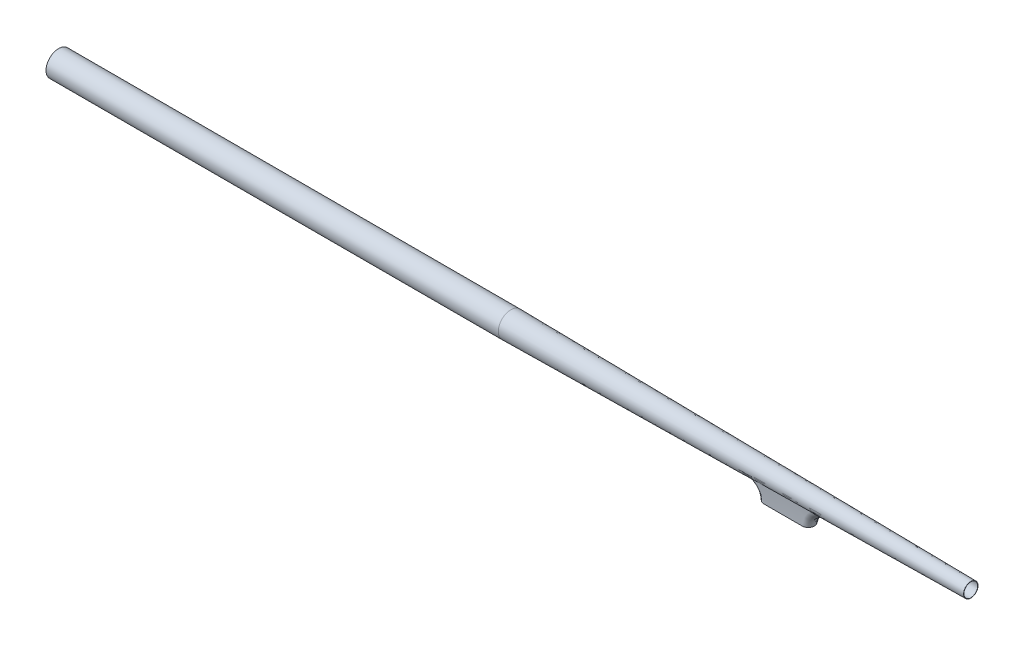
ISO-10303-21;
HEADER;
FILE_DESCRIPTION(('STEP AP214'),'2;1');
FILE_NAME('part.step','',(''),(''),'','','');
FILE_SCHEMA(('AUTOMOTIVE_DESIGN { 1 0 10303 214 1 1 1 1 }'));
ENDSEC;
DATA;
#1=APPLICATION_CONTEXT('core data for automotive mechanical design processes');
#2=APPLICATION_PROTOCOL_DEFINITION('international standard','automotive_design',2000,#1);
#3=PRODUCT_CONTEXT('',#1,'mechanical');
#4=PRODUCT('Part','Part','',(#3));
#5=PRODUCT_RELATED_PRODUCT_CATEGORY('part','',(#4));
#6=PRODUCT_DEFINITION_FORMATION('','',#4);
#7=PRODUCT_DEFINITION_CONTEXT('part definition',#1,'design');
#8=PRODUCT_DEFINITION('design','',#6,#7);
#9=PRODUCT_DEFINITION_SHAPE('','',#8);
#10=(LENGTH_UNIT() NAMED_UNIT(*) SI_UNIT(.MILLI.,.METRE.));
#11=(NAMED_UNIT(*) PLANE_ANGLE_UNIT() SI_UNIT($,.RADIAN.));
#12=(NAMED_UNIT(*) SI_UNIT($,.STERADIAN.) SOLID_ANGLE_UNIT());
#13=UNCERTAINTY_MEASURE_WITH_UNIT(LENGTH_MEASURE(1.E-05),#10,'distance_accuracy_value','');
#14=(GEOMETRIC_REPRESENTATION_CONTEXT(3) GLOBAL_UNCERTAINTY_ASSIGNED_CONTEXT((#13)) GLOBAL_UNIT_ASSIGNED_CONTEXT((#10,
#11,#12)) REPRESENTATION_CONTEXT('',''));
#15=CARTESIAN_POINT('',(0.,0.,0.));
#16=DIRECTION('',(0.,0.,1.));
#17=DIRECTION('',(1.,0.,0.));
#18=AXIS2_PLACEMENT_3D('',#15,#16,#17);
#19=CARTESIAN_POINT('',(476.499999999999,-15.,-38.2939713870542));
#20=DIRECTION('',(0.,-1.,0.));
#21=DIRECTION('',(0.,0.,-1.));
#22=AXIS2_PLACEMENT_3D('',#19,#20,#21);
#23=PLANE('',#22);
#24=DIRECTION('',(-1.,0.,0.));
#25=VECTOR('',#24,1.);
#26=CARTESIAN_POINT('',(488.999999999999,-15.,-4.));
#27=LINE('',#26,#25);
#28=CARTESIAN_POINT('',(488.999999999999,-15.,-4.));
#29=VERTEX_POINT('',#28);
#30=CARTESIAN_POINT('',(463.999999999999,-15.,-4.));
#31=VERTEX_POINT('',#30);
#32=EDGE_CURVE('E195',#29,#31,#27,.T.);
#33=ORIENTED_EDGE('',*,*,#32,.T.);
#34=CARTESIAN_POINT('',(463.999999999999,-15.,0.));
#35=DIRECTION('',(0.,-1.,0.));
#36=DIRECTION('',(0.,0.,-1.));
#37=AXIS2_PLACEMENT_3D('',#34,#35,#36);
#38=CIRCLE('',#37,4.);
#39=CARTESIAN_POINT('',(463.999999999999,-15.,4.));
#40=VERTEX_POINT('',#39);
#41=EDGE_CURVE('E14',#31,#40,#38,.F.);
#42=ORIENTED_EDGE('',*,*,#41,.T.);
#43=DIRECTION('',(1.,0.,0.));
#44=VECTOR('',#43,1.);
#45=CARTESIAN_POINT('',(488.999999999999,-15.,4.));
#46=LINE('',#45,#44);
#47=CARTESIAN_POINT('',(488.999999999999,-15.,4.));
#48=VERTEX_POINT('',#47);
#49=EDGE_CURVE('E180',#40,#48,#46,.T.);
#50=ORIENTED_EDGE('',*,*,#49,.T.);
#51=CARTESIAN_POINT('',(488.999999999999,-15.,0.));
#52=DIRECTION('',(0.,-1.,0.));
#53=DIRECTION('',(0.,0.,-1.));
#54=AXIS2_PLACEMENT_3D('',#51,#52,#53);
#55=CIRCLE('',#54,4.);
#56=EDGE_CURVE('E193',#48,#29,#55,.F.);
#57=ORIENTED_EDGE('',*,*,#56,.T.);
#58=EDGE_LOOP('',(#33,#42,#50,#57));
#59=FACE_BOUND('',#58,.T.);
#60=ADVANCED_FACE('F174',(#59),#23,.F.);
#61=OPEN_SHELL('',(#60));
#62=SHELL_BASED_SURFACE_MODEL('B2',(#61));
#63=CARTESIAN_POINT('',(594.999999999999,0.,0.));
#64=DIRECTION('',(-1.,0.,0.));
#65=DIRECTION('',(0.,0.,1.));
#66=AXIS2_PLACEMENT_3D('',#63,#64,#65);
#67=CONICAL_SURFACE('',#66,4.7,0.0116661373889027);
#68=CARTESIAN_POINT('',(594.999999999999,0.,0.));
#69=DIRECTION('',(-1.,0.,0.));
#70=DIRECTION('',(0.,0.,1.));
#71=AXIS2_PLACEMENT_3D('',#68,#69,#70);
#72=CIRCLE('',#71,4.7);
#73=CARTESIAN_POINT('',(594.999999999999,0.,4.7));
#74=VERTEX_POINT('',#73);
#75=EDGE_CURVE('E332',#74,#74,#72,.T.);
#76=ORIENTED_EDGE('',*,*,#75,.T.);
#77=EDGE_LOOP('',(#76));
#78=FACE_BOUND('',#77,.T.);
#79=CARTESIAN_POINT('',(295.,0.,0.));
#80=DIRECTION('',(-1.,0.,0.));
#81=DIRECTION('',(0.,0.,1.));
#82=AXIS2_PLACEMENT_3D('',#79,#80,#81);
#83=CIRCLE('',#82,8.2);
#84=CARTESIAN_POINT('',(295.,0.,8.2));
#85=VERTEX_POINT('',#84);
#86=EDGE_CURVE('E763',#85,#85,#83,.T.);
#87=ORIENTED_EDGE('',*,*,#86,.F.);
#88=EDGE_LOOP('',(#87));
#89=FACE_BOUND('',#88,.T.);
#90=CARTESIAN_POINT('',(499.866267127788,-5.80989318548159,-1.50773144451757E-05));
#91=CARTESIAN_POINT('',(499.866312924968,-5.80994478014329,0.673730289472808));
#92=CARTESIAN_POINT('',(499.648551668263,-5.62814085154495,1.66854342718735));
#93=CARTESIAN_POINT('',(499.04318426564,-5.14683328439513,2.75904295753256));
#94=CARTESIAN_POINT('',(498.464410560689,-4.7128682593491,3.45596089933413));
#95=CARTESIAN_POINT('',(497.782383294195,-4.23998236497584,4.02624651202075));
#96=CARTESIAN_POINT('',(496.99504583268,-3.77838419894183,4.47000321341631));
#97=CARTESIAN_POINT('',(496.092255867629,-3.39219548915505,4.77629412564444));
#98=CARTESIAN_POINT('',(495.40547953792,-3.27483364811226,4.8618680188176));
#99=CARTESIAN_POINT('',(492.164230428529,-3.28637707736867,4.89968259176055));
#100=CARTESIAN_POINT('',(486.358268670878,-3.30695733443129,4.96741881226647));
#101=CARTESIAN_POINT('',(477.60645844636,-3.33769167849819,5.06952326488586));
#102=CARTESIAN_POINT('',(468.832612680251,-3.36822175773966,5.1718847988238));
#103=CARTESIAN_POINT('',(462.982928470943,-3.38839374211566,5.24013111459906));
#104=CARTESIAN_POINT('',(459.691184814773,-3.39969494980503,5.27853479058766));
#105=CARTESIAN_POINT('',(458.95278358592,-3.53372714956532,5.20565462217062));
#106=CARTESIAN_POINT('',(457.965429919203,-3.97419857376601,4.90046855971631));
#107=CARTESIAN_POINT('',(457.091792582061,-4.50494906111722,4.43732625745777));
#108=CARTESIAN_POINT('',(456.324462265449,-5.05342006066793,3.82562402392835));
#109=CARTESIAN_POINT('',(455.667353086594,-5.55981143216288,3.06532892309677));
#110=CARTESIAN_POINT('',(455.147201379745,-5.98358128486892,2.15823501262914));
#111=CARTESIAN_POINT('',(454.808028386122,-6.26597879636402,1.11862117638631));
#112=CARTESIAN_POINT('',(454.725451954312,-6.33651028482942,0.372942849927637));
#113=CARTESIAN_POINT('',(454.725402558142,-6.33656255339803,-0.37295282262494));
#114=CARTESIAN_POINT('',(454.807513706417,-6.26635238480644,-1.118822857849));
#115=CARTESIAN_POINT('',(455.147468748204,-5.98344006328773,-2.15803707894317));
#116=CARTESIAN_POINT('',(455.666790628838,-5.5600827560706,-3.06590476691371));
#117=CARTESIAN_POINT('',(456.324743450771,-5.05339495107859,-3.82536062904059));
#118=CARTESIAN_POINT('',(457.091381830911,-4.50477701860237,-4.43802523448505));
#119=CARTESIAN_POINT('',(457.965727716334,-3.97438362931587,-4.90014846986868));
#120=CARTESIAN_POINT('',(458.952444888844,-3.53281516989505,-5.20651531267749));
#121=CARTESIAN_POINT('',(459.691172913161,-3.39969499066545,-5.27853492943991));
#122=CARTESIAN_POINT('',(462.982944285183,-3.38839368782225,-5.24013093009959));
#123=CARTESIAN_POINT('',(468.832653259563,-3.36822168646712,-5.17188432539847));
#124=CARTESIAN_POINT('',(477.606512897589,-3.33769149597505,-5.06952262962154));
#125=CARTESIAN_POINT('',(486.35831161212,-3.30695710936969,-4.96741831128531));
#126=CARTESIAN_POINT('',(492.164247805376,-3.28637701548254,-4.89968238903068));
#127=CARTESIAN_POINT('',(495.405482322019,-3.27483363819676,-4.86186798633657));
#128=CARTESIAN_POINT('',(496.092037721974,-3.39289157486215,-4.77566054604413));
#129=CARTESIAN_POINT('',(496.995294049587,-3.77826262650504,-4.47016789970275));
#130=CARTESIAN_POINT('',(497.782233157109,-4.24015616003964,-4.0258821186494));
#131=CARTESIAN_POINT('',(498.464622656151,-4.71291607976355,-3.45601005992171));
#132=CARTESIAN_POINT('',(499.043019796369,-5.14674729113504,-2.7588475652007));
#133=CARTESIAN_POINT('',(499.648873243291,-5.62838531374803,-1.66861069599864));
#134=CARTESIAN_POINT('',(499.866221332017,-5.80984159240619,-0.673739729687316));
#135=CARTESIAN_POINT('',(499.866267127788,-5.80989318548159,-1.50773144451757E-05));
#136=B_SPLINE_CURVE_WITH_KNOTS('',3,(#90,#91,#92,#93,#94,#95,#96,#97,#98,#99,#100,#101,#102,
#103,#104,#105,#106,#107,#108,#109,#110,#111,#112,#113,#114,#115,#116,#117,#118,#119,#120,#121,
#122,#123,#124,#125,#126,#127,#128,#129,#130,#131,#132,#133,#134,#135),.UNSPECIFIED.,.T.,.F.,(4,
1,1,1,1,1,1,2,1,1,1,2,1,1,1,1,1,1,1,2,1,1,1,1,1,1,1,2,1,1,1,2,1,1,1,1,1,1,4),(0.,
0.0201649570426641,0.0302474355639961,0.0403299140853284,0.0504123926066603,0.0604948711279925,
0.0705773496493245,0.0806598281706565,0.164290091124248,0.247920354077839,0.33155061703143,
0.415180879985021,0.425783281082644,0.436385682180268,0.446988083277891,0.457590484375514,
0.468192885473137,0.478795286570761,0.489397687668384,0.500000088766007,0.510602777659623,
0.521205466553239,0.531808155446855,0.542410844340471,0.553013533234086,0.563616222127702,
0.574218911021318,0.584821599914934,0.668451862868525,0.752082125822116,0.835712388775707,
0.919342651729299,0.929424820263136,0.939506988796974,0.949589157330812,0.959671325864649,
0.969753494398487,0.979835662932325,1.),.UNSPECIFIED.);
#137=CARTESIAN_POINT('',(483.754639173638,-3.31608283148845,-4.99779448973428));
#138=VERTEX_POINT('',#137);
#139=CARTESIAN_POINT('',(496.987789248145,-3.7969856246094,-4.44174622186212));
#140=VERTEX_POINT('',#139);
#141=EDGE_CURVE('E364',#138,#140,#136,.T.);
#142=ORIENTED_EDGE('',*,*,#141,.F.);
#143=CARTESIAN_POINT('',(499.866267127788,-5.80989318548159,-1.50773144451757E-05));
#144=CARTESIAN_POINT('',(499.866312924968,-5.80994478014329,0.673730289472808));
#145=CARTESIAN_POINT('',(499.648551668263,-5.62814085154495,1.66854342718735));
#146=CARTESIAN_POINT('',(499.04318426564,-5.14683328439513,2.75904295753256));
#147=CARTESIAN_POINT('',(498.464410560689,-4.7128682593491,3.45596089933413));
#148=CARTESIAN_POINT('',(497.782383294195,-4.23998236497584,4.02624651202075));
#149=CARTESIAN_POINT('',(496.99504583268,-3.77838419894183,4.47000321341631));
#150=CARTESIAN_POINT('',(496.092255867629,-3.39219548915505,4.77629412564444));
#151=CARTESIAN_POINT('',(495.40547953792,-3.27483364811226,4.8618680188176));
#152=CARTESIAN_POINT('',(492.164230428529,-3.28637707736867,4.89968259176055));
#153=CARTESIAN_POINT('',(486.358268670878,-3.30695733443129,4.96741881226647));
#154=CARTESIAN_POINT('',(477.60645844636,-3.33769167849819,5.06952326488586));
#155=CARTESIAN_POINT('',(468.832612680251,-3.36822175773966,5.1718847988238));
#156=CARTESIAN_POINT('',(462.982928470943,-3.38839374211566,5.24013111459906));
#157=CARTESIAN_POINT('',(459.691184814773,-3.39969494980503,5.27853479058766));
#158=CARTESIAN_POINT('',(458.95278358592,-3.53372714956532,5.20565462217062));
#159=CARTESIAN_POINT('',(457.965429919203,-3.97419857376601,4.90046855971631));
#160=CARTESIAN_POINT('',(457.091792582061,-4.50494906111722,4.43732625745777));
#161=CARTESIAN_POINT('',(456.324462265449,-5.05342006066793,3.82562402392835));
#162=CARTESIAN_POINT('',(455.667353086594,-5.55981143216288,3.06532892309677));
#163=CARTESIAN_POINT('',(455.147201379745,-5.98358128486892,2.15823501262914));
#164=CARTESIAN_POINT('',(454.808028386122,-6.26597879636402,1.11862117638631));
#165=CARTESIAN_POINT('',(454.725451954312,-6.33651028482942,0.372942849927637));
#166=CARTESIAN_POINT('',(454.725402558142,-6.33656255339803,-0.37295282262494));
#167=CARTESIAN_POINT('',(454.807513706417,-6.26635238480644,-1.118822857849));
#168=CARTESIAN_POINT('',(455.147468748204,-5.98344006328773,-2.15803707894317));
#169=CARTESIAN_POINT('',(455.666790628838,-5.5600827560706,-3.06590476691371));
#170=CARTESIAN_POINT('',(456.324743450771,-5.05339495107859,-3.82536062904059));
#171=CARTESIAN_POINT('',(457.091381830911,-4.50477701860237,-4.43802523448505));
#172=CARTESIAN_POINT('',(457.965727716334,-3.97438362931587,-4.90014846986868));
#173=CARTESIAN_POINT('',(458.952444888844,-3.53281516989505,-5.20651531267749));
#174=CARTESIAN_POINT('',(459.691172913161,-3.39969499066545,-5.27853492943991));
#175=CARTESIAN_POINT('',(462.982944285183,-3.38839368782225,-5.24013093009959));
#176=CARTESIAN_POINT('',(468.832653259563,-3.36822168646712,-5.17188432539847));
#177=CARTESIAN_POINT('',(477.606512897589,-3.33769149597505,-5.06952262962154));
#178=CARTESIAN_POINT('',(486.35831161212,-3.30695710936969,-4.96741831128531));
#179=CARTESIAN_POINT('',(492.164247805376,-3.28637701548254,-4.89968238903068));
#180=CARTESIAN_POINT('',(495.405482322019,-3.27483363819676,-4.86186798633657));
#181=CARTESIAN_POINT('',(496.092037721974,-3.39289157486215,-4.77566054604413));
#182=CARTESIAN_POINT('',(496.995294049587,-3.77826262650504,-4.47016789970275));
#183=CARTESIAN_POINT('',(497.782233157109,-4.24015616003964,-4.0258821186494));
#184=CARTESIAN_POINT('',(498.464622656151,-4.71291607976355,-3.45601005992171));
#185=CARTESIAN_POINT('',(499.043019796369,-5.14674729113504,-2.7588475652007));
#186=CARTESIAN_POINT('',(499.648873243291,-5.62838531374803,-1.66861069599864));
#187=CARTESIAN_POINT('',(499.866221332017,-5.80984159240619,-0.673739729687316));
#188=CARTESIAN_POINT('',(499.866267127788,-5.80989318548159,-1.50773144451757E-05));
#189=B_SPLINE_CURVE_WITH_KNOTS('',3,(#143,#144,#145,#146,#147,#148,#149,#150,#151,#152,#153,
#154,#155,#156,#157,#158,#159,#160,#161,#162,#163,#164,#165,#166,#167,#168,#169,#170,#171,#172,
#173,#174,#175,#176,#177,#178,#179,#180,#181,#182,#183,#184,#185,#186,#187,#188),.UNSPECIFIED.,
.T.,.F.,(4,1,1,1,1,1,1,2,1,1,1,2,1,1,1,1,1,1,1,2,1,1,1,1,1,1,1,2,1,1,1,2,1,1,1,1,1,1,4),(0.,
0.0201649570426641,0.0302474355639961,0.0403299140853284,0.0504123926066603,0.0604948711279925,
0.0705773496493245,0.0806598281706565,0.164290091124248,0.247920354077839,0.33155061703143,
0.415180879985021,0.425783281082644,0.436385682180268,0.446988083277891,0.457590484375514,
0.468192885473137,0.478795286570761,0.489397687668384,0.500000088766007,0.510602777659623,
0.521205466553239,0.531808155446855,0.542410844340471,0.553013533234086,0.563616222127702,
0.574218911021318,0.584821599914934,0.668451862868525,0.752082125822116,0.835712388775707,
0.919342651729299,0.929424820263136,0.939506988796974,0.949589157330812,0.959671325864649,
0.969753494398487,0.979835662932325,1.),.UNSPECIFIED.);
#190=CARTESIAN_POINT('',(457.975492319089,-3.99387615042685,-4.87047819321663));
#191=VERTEX_POINT('',#190);
#192=EDGE_CURVE('E360',#191,#138,#189,.T.);
#193=ORIENTED_EDGE('',*,*,#192,.F.);
#194=CARTESIAN_POINT('',(456.357671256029,-5.03544145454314,-3.81510913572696));
#195=CARTESIAN_POINT('',(456.419683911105,-4.98967465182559,-3.87431728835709));
#196=CARTESIAN_POINT('',(456.482920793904,-4.94343837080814,-3.93187733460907));
#197=CARTESIAN_POINT('',(456.610839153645,-4.85110064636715,-4.04280854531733));
#198=CARTESIAN_POINT('',(456.67548271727,-4.80500834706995,-4.09623104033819));
#199=CARTESIAN_POINT('',(456.806098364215,-4.71331820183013,-4.19901784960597));
#200=CARTESIAN_POINT('',(456.872032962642,-4.66772415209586,-4.24843319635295));
#201=CARTESIAN_POINT('',(457.005116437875,-4.57735665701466,-4.34333628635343));
#202=CARTESIAN_POINT('',(457.072228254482,-4.53258190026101,-4.38887474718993));
#203=CARTESIAN_POINT('',(457.207557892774,-4.44415721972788,-4.47615279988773));
#204=CARTESIAN_POINT('',(457.275739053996,-4.40050094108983,-4.51794277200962));
#205=CARTESIAN_POINT('',(457.413128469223,-4.3146352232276,-4.59784625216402));
#206=CARTESIAN_POINT('',(457.482300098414,-4.27241379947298,-4.63600981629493));
#207=CARTESIAN_POINT('',(457.621587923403,-4.18970292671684,-4.70878297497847));
#208=CARTESIAN_POINT('',(457.691667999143,-4.1491962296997,-4.74344200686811));
#209=CARTESIAN_POINT('',(457.832685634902,-4.07017154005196,-4.80932800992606));
#210=CARTESIAN_POINT('',(457.903588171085,-4.03163140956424,-4.84060344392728));
#211=CARTESIAN_POINT('',(457.975492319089,-3.99387615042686,-4.87047819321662));
#212=B_SPLINE_CURVE_WITH_KNOTS('',3,(#194,#195,#196,#197,#198,#199,#200,#201,#202,#203,#204,
#205,#206,#207,#208,#209,#210,#211),.UNSPECIFIED.,.F.,.F.,(4,2,2,2,2,2,2,2,4),(0.,
0.291542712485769,0.578538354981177,0.860969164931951,1.13881743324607,1.41206948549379,
1.68072051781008,1.94479863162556,2.20437167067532),.UNSPECIFIED.);
#213=CARTESIAN_POINT('',(456.357671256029,-5.03544145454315,-3.81510913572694));
#214=VERTEX_POINT('',#213);
#215=EDGE_CURVE('E503',#191,#214,#212,.F.);
#216=ORIENTED_EDGE('',*,*,#215,.T.);
#217=CARTESIAN_POINT('',(499.866267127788,-5.80989318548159,-1.50773144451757E-05));
#218=CARTESIAN_POINT('',(499.866312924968,-5.80994478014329,0.673730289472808));
#219=CARTESIAN_POINT('',(499.648551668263,-5.62814085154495,1.66854342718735));
#220=CARTESIAN_POINT('',(499.04318426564,-5.14683328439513,2.75904295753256));
#221=CARTESIAN_POINT('',(498.464410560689,-4.7128682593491,3.45596089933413));
#222=CARTESIAN_POINT('',(497.782383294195,-4.23998236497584,4.02624651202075));
#223=CARTESIAN_POINT('',(496.99504583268,-3.77838419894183,4.47000321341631));
#224=CARTESIAN_POINT('',(496.092255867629,-3.39219548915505,4.77629412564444));
#225=CARTESIAN_POINT('',(495.40547953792,-3.27483364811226,4.8618680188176));
#226=CARTESIAN_POINT('',(492.164230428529,-3.28637707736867,4.89968259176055));
#227=CARTESIAN_POINT('',(486.358268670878,-3.30695733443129,4.96741881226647));
#228=CARTESIAN_POINT('',(477.60645844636,-3.33769167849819,5.06952326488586));
#229=CARTESIAN_POINT('',(468.832612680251,-3.36822175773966,5.1718847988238));
#230=CARTESIAN_POINT('',(462.982928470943,-3.38839374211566,5.24013111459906));
#231=CARTESIAN_POINT('',(459.691184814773,-3.39969494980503,5.27853479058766));
#232=CARTESIAN_POINT('',(458.95278358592,-3.53372714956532,5.20565462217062));
#233=CARTESIAN_POINT('',(457.965429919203,-3.97419857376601,4.90046855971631));
#234=CARTESIAN_POINT('',(457.091792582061,-4.50494906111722,4.43732625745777));
#235=CARTESIAN_POINT('',(456.324462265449,-5.05342006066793,3.82562402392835));
#236=CARTESIAN_POINT('',(455.667353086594,-5.55981143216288,3.06532892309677));
#237=CARTESIAN_POINT('',(455.147201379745,-5.98358128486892,2.15823501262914));
#238=CARTESIAN_POINT('',(454.808028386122,-6.26597879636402,1.11862117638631));
#239=CARTESIAN_POINT('',(454.725451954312,-6.33651028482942,0.372942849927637));
#240=CARTESIAN_POINT('',(454.725402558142,-6.33656255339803,-0.37295282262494));
#241=CARTESIAN_POINT('',(454.807513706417,-6.26635238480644,-1.118822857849));
#242=CARTESIAN_POINT('',(455.147468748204,-5.98344006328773,-2.15803707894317));
#243=CARTESIAN_POINT('',(455.666790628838,-5.5600827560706,-3.06590476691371));
#244=CARTESIAN_POINT('',(456.324743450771,-5.05339495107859,-3.82536062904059));
#245=CARTESIAN_POINT('',(457.091381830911,-4.50477701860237,-4.43802523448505));
#246=CARTESIAN_POINT('',(457.965727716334,-3.97438362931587,-4.90014846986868));
#247=CARTESIAN_POINT('',(458.952444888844,-3.53281516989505,-5.20651531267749));
#248=CARTESIAN_POINT('',(459.691172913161,-3.39969499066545,-5.27853492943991));
#249=CARTESIAN_POINT('',(462.982944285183,-3.38839368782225,-5.24013093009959));
#250=CARTESIAN_POINT('',(468.832653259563,-3.36822168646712,-5.17188432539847));
#251=CARTESIAN_POINT('',(477.606512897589,-3.33769149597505,-5.06952262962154));
#252=CARTESIAN_POINT('',(486.35831161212,-3.30695710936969,-4.96741831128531));
#253=CARTESIAN_POINT('',(492.164247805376,-3.28637701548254,-4.89968238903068));
#254=CARTESIAN_POINT('',(495.405482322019,-3.27483363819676,-4.86186798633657));
#255=CARTESIAN_POINT('',(496.092037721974,-3.39289157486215,-4.77566054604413));
#256=CARTESIAN_POINT('',(496.995294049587,-3.77826262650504,-4.47016789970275));
#257=CARTESIAN_POINT('',(497.782233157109,-4.24015616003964,-4.0258821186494));
#258=CARTESIAN_POINT('',(498.464622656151,-4.71291607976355,-3.45601005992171));
#259=CARTESIAN_POINT('',(499.043019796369,-5.14674729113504,-2.7588475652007));
#260=CARTESIAN_POINT('',(499.648873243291,-5.62838531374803,-1.66861069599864));
#261=CARTESIAN_POINT('',(499.866221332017,-5.80984159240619,-0.673739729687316));
#262=CARTESIAN_POINT('',(499.866267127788,-5.80989318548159,-1.50773144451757E-05));
#263=B_SPLINE_CURVE_WITH_KNOTS('',3,(#217,#218,#219,#220,#221,#222,#223,#224,#225,#226,#227,
#228,#229,#230,#231,#232,#233,#234,#235,#236,#237,#238,#239,#240,#241,#242,#243,#244,#245,#246,
#247,#248,#249,#250,#251,#252,#253,#254,#255,#256,#257,#258,#259,#260,#261,#262),.UNSPECIFIED.,
.T.,.F.,(4,1,1,1,1,1,1,2,1,1,1,2,1,1,1,1,1,1,1,2,1,1,1,1,1,1,1,2,1,1,1,2,1,1,1,1,1,1,4),(0.,
0.0201649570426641,0.0302474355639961,0.0403299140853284,0.0504123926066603,0.0604948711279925,
0.0705773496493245,0.0806598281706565,0.164290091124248,0.247920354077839,0.33155061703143,
0.415180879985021,0.425783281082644,0.436385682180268,0.446988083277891,0.457590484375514,
0.468192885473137,0.478795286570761,0.489397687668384,0.500000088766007,0.510602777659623,
0.521205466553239,0.531808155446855,0.542410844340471,0.553013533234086,0.563616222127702,
0.574218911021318,0.584821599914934,0.668451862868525,0.752082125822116,0.835712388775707,
0.919342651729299,0.929424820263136,0.939506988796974,0.949589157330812,0.959671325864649,
0.969753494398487,0.979835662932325,1.),.UNSPECIFIED.);
#264=CARTESIAN_POINT('',(455.8543519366,-5.41729403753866,-3.26157654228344));
#265=VERTEX_POINT('',#264);
#266=EDGE_CURVE('E356',#265,#214,#263,.T.);
#267=ORIENTED_EDGE('',*,*,#266,.F.);
#268=CARTESIAN_POINT('',(455.610092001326,-5.60947710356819,-2.92485390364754));
#269=CARTESIAN_POINT('',(455.618590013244,-5.60272097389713,-2.93759680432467));
#270=CARTESIAN_POINT('',(455.627135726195,-5.59593364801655,-2.95029134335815));
#271=CARTESIAN_POINT('',(455.644667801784,-5.5820236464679,-2.97609278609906));
#272=CARTESIAN_POINT('',(455.653658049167,-5.57489847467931,-2.98919570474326));
#273=CARTESIAN_POINT('',(455.67208961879,-5.56030738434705,-3.01580110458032));
#274=CARTESIAN_POINT('',(455.681534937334,-5.55283894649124,-3.02929943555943));
#275=CARTESIAN_POINT('',(455.700887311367,-5.53755600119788,-3.05668239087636));
#276=CARTESIAN_POINT('',(455.710798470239,-5.52973895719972,-3.07056269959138));
#277=CARTESIAN_POINT('',(455.731093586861,-5.51375315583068,-3.09869628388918));
#278=CARTESIAN_POINT('',(455.741481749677,-5.50558184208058,-3.1129450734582));
#279=CARTESIAN_POINT('',(455.76274218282,-5.48888192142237,-3.14180193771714));
#280=CARTESIAN_POINT('',(455.773618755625,-5.48035074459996,-3.15640535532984));
#281=CARTESIAN_POINT('',(455.795867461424,-5.46292567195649,-3.1859573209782));
#282=CARTESIAN_POINT('',(455.807243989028,-5.45402919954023,-3.20090104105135));
#283=CARTESIAN_POINT('',(455.830504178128,-5.43586829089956,-3.23111900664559));
#284=CARTESIAN_POINT('',(455.842392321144,-5.42660127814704,-3.24638825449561));
#285=CARTESIAN_POINT('',(455.854351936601,-5.41729403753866,-3.26157654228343));
#286=B_SPLINE_CURVE_WITH_KNOTS('',3,(#268,#269,#270,#271,#272,#273,#274,#275,#276,#277,#278,
#279,#280,#281,#282,#283,#284,#285),.UNSPECIFIED.,.F.,.F.,(4,2,2,2,2,2,2,2,4),(0.,
0.0502212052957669,0.102465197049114,0.156730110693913,0.213014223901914,0.271317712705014,
0.331641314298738,0.393985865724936,0.458352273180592),.UNSPECIFIED.);
#287=CARTESIAN_POINT('',(455.610092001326,-5.60947710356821,-2.9248539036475));
#288=VERTEX_POINT('',#287);
#289=EDGE_CURVE('E504',#265,#288,#286,.F.);
#290=ORIENTED_EDGE('',*,*,#289,.T.);
#291=CARTESIAN_POINT('',(499.866267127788,-5.80989318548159,-1.50773144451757E-05));
#292=CARTESIAN_POINT('',(499.866312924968,-5.80994478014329,0.673730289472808));
#293=CARTESIAN_POINT('',(499.648551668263,-5.62814085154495,1.66854342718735));
#294=CARTESIAN_POINT('',(499.04318426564,-5.14683328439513,2.75904295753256));
#295=CARTESIAN_POINT('',(498.464410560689,-4.7128682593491,3.45596089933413));
#296=CARTESIAN_POINT('',(497.782383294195,-4.23998236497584,4.02624651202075));
#297=CARTESIAN_POINT('',(496.99504583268,-3.77838419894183,4.47000321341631));
#298=CARTESIAN_POINT('',(496.092255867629,-3.39219548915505,4.77629412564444));
#299=CARTESIAN_POINT('',(495.40547953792,-3.27483364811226,4.8618680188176));
#300=CARTESIAN_POINT('',(492.164230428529,-3.28637707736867,4.89968259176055));
#301=CARTESIAN_POINT('',(486.358268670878,-3.30695733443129,4.96741881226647));
#302=CARTESIAN_POINT('',(477.60645844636,-3.33769167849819,5.06952326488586));
#303=CARTESIAN_POINT('',(468.832612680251,-3.36822175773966,5.1718847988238));
#304=CARTESIAN_POINT('',(462.982928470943,-3.38839374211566,5.24013111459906));
#305=CARTESIAN_POINT('',(459.691184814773,-3.39969494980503,5.27853479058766));
#306=CARTESIAN_POINT('',(458.95278358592,-3.53372714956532,5.20565462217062));
#307=CARTESIAN_POINT('',(457.965429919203,-3.97419857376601,4.90046855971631));
#308=CARTESIAN_POINT('',(457.091792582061,-4.50494906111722,4.43732625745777));
#309=CARTESIAN_POINT('',(456.324462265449,-5.05342006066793,3.82562402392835));
#310=CARTESIAN_POINT('',(455.667353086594,-5.55981143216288,3.06532892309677));
#311=CARTESIAN_POINT('',(455.147201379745,-5.98358128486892,2.15823501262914));
#312=CARTESIAN_POINT('',(454.808028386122,-6.26597879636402,1.11862117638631));
#313=CARTESIAN_POINT('',(454.725451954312,-6.33651028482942,0.372942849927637));
#314=CARTESIAN_POINT('',(454.725402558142,-6.33656255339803,-0.37295282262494));
#315=CARTESIAN_POINT('',(454.807513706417,-6.26635238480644,-1.118822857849));
#316=CARTESIAN_POINT('',(455.147468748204,-5.98344006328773,-2.15803707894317));
#317=CARTESIAN_POINT('',(455.666790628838,-5.5600827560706,-3.06590476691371));
#318=CARTESIAN_POINT('',(456.324743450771,-5.05339495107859,-3.82536062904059));
#319=CARTESIAN_POINT('',(457.091381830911,-4.50477701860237,-4.43802523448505));
#320=CARTESIAN_POINT('',(457.965727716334,-3.97438362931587,-4.90014846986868));
#321=CARTESIAN_POINT('',(458.952444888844,-3.53281516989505,-5.20651531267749));
#322=CARTESIAN_POINT('',(459.691172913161,-3.39969499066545,-5.27853492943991));
#323=CARTESIAN_POINT('',(462.982944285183,-3.38839368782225,-5.24013093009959));
#324=CARTESIAN_POINT('',(468.832653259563,-3.36822168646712,-5.17188432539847));
#325=CARTESIAN_POINT('',(477.606512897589,-3.33769149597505,-5.06952262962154));
#326=CARTESIAN_POINT('',(486.35831161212,-3.30695710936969,-4.96741831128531));
#327=CARTESIAN_POINT('',(492.164247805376,-3.28637701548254,-4.89968238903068));
#328=CARTESIAN_POINT('',(495.405482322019,-3.27483363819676,-4.86186798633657));
#329=CARTESIAN_POINT('',(496.092037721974,-3.39289157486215,-4.77566054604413));
#330=CARTESIAN_POINT('',(496.995294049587,-3.77826262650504,-4.47016789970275));
#331=CARTESIAN_POINT('',(497.782233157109,-4.24015616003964,-4.0258821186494));
#332=CARTESIAN_POINT('',(498.464622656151,-4.71291607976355,-3.45601005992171));
#333=CARTESIAN_POINT('',(499.043019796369,-5.14674729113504,-2.7588475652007));
#334=CARTESIAN_POINT('',(499.648873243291,-5.62838531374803,-1.66861069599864));
#335=CARTESIAN_POINT('',(499.866221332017,-5.80984159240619,-0.673739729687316));
#336=CARTESIAN_POINT('',(499.866267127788,-5.80989318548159,-1.50773144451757E-05));
#337=B_SPLINE_CURVE_WITH_KNOTS('',3,(#291,#292,#293,#294,#295,#296,#297,#298,#299,#300,#301,
#302,#303,#304,#305,#306,#307,#308,#309,#310,#311,#312,#313,#314,#315,#316,#317,#318,#319,#320,
#321,#322,#323,#324,#325,#326,#327,#328,#329,#330,#331,#332,#333,#334,#335,#336),.UNSPECIFIED.,
.T.,.F.,(4,1,1,1,1,1,1,2,1,1,1,2,1,1,1,1,1,1,1,2,1,1,1,1,1,1,1,2,1,1,1,2,1,1,1,1,1,1,4),(0.,
0.0201649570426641,0.0302474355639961,0.0403299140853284,0.0504123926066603,0.0604948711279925,
0.0705773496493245,0.0806598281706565,0.164290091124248,0.247920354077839,0.33155061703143,
0.415180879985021,0.425783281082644,0.436385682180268,0.446988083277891,0.457590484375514,
0.468192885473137,0.478795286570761,0.489397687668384,0.500000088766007,0.510602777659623,
0.521205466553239,0.531808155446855,0.542410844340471,0.553013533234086,0.563616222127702,
0.574218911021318,0.584821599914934,0.668451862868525,0.752082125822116,0.835712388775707,
0.919342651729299,0.929424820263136,0.939506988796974,0.949589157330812,0.959671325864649,
0.969753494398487,0.979835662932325,1.),.UNSPECIFIED.);
#338=CARTESIAN_POINT('',(455.171064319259,-5.96521060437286,-2.12181479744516));
#339=VERTEX_POINT('',#338);
#340=EDGE_CURVE('E352',#339,#288,#337,.T.);
#341=ORIENTED_EDGE('',*,*,#340,.F.);
#342=CARTESIAN_POINT('',(454.725433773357,-6.33653096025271,-0.00848062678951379));
#343=CARTESIAN_POINT('',(454.725578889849,-6.33651563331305,-0.054582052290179));
#344=CARTESIAN_POINT('',(454.726346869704,-6.33596103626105,-0.10068028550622));
#345=CARTESIAN_POINT('',(454.729109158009,-6.33379483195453,-0.192822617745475));
#346=CARTESIAN_POINT('',(454.731103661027,-6.33218305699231,-0.238866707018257));
#347=CARTESIAN_POINT('',(454.736300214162,-6.32792349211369,-0.330850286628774));
#348=CARTESIAN_POINT('',(454.739502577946,-6.3252754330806,-0.37678974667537));
#349=CARTESIAN_POINT('',(454.747096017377,-6.31896432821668,-0.468514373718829));
#350=CARTESIAN_POINT('',(454.751487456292,-6.31530097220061,-0.514299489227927));
#351=CARTESIAN_POINT('',(454.761440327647,-6.30698019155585,-0.605665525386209));
#352=CARTESIAN_POINT('',(454.767002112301,-6.30232246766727,-0.651246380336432));
#353=CARTESIAN_POINT('',(454.779277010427,-6.29203381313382,-0.742154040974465));
#354=CARTESIAN_POINT('',(454.785990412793,-6.2864026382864,-0.7874807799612));
#355=CARTESIAN_POINT('',(454.800549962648,-6.27418786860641,-0.877830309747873));
#356=CARTESIAN_POINT('',(454.808396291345,-6.26760412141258,-0.922853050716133));
#357=CARTESIAN_POINT('',(454.825203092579,-6.25350499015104,-1.01254471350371));
#358=CARTESIAN_POINT('',(454.834163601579,-6.24598957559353,-1.05721362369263));
#359=CARTESIAN_POINT('',(454.853180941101,-6.23004726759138,-1.14614979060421));
#360=CARTESIAN_POINT('',(454.863237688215,-6.22162044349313,-1.19041707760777));
#361=CARTESIAN_POINT('',(454.884423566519,-6.2038790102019,-1.27851469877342));
#362=CARTESIAN_POINT('',(454.895552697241,-6.19456440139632,-1.32234503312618));
#363=CARTESIAN_POINT('',(454.918859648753,-6.17507083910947,-1.40953640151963));
#364=CARTESIAN_POINT('',(454.931037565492,-6.16489180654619,-1.45289739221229));
#365=CARTESIAN_POINT('',(454.956418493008,-6.14369275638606,-1.53911758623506));
#366=CARTESIAN_POINT('',(454.96962164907,-6.13267261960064,-1.58197671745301));
#367=CARTESIAN_POINT('',(454.997029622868,-6.10981457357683,-1.66716097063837));
#368=CARTESIAN_POINT('',(455.011234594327,-6.09797653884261,-1.7094860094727));
#369=CARTESIAN_POINT('',(455.040622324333,-6.07350626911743,-1.79356880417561));
#370=CARTESIAN_POINT('',(455.055805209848,-6.06087393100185,-1.83532648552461));
#371=CARTESIAN_POINT('',(455.102784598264,-6.021821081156,-1.95969657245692));
#372=CARTESIAN_POINT('',(455.136012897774,-5.99424384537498,-2.04140932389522));
#373=CARTESIAN_POINT('',(455.171064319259,-5.96521060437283,-2.12181479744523));
#374=B_SPLINE_CURVE_WITH_KNOTS('',3,(#342,#343,#344,#345,#346,#347,#348,#349,#350,#351,#352,
#353,#354,#355,#356,#357,#358,#359,#360,#361,#362,#363,#364,#365,#366,#367,#368,#369,#370,#371,
#372,#373),.UNSPECIFIED.,.F.,.F.,(4,2,2,2,2,2,2,2,2,2,2,2,2,2,2,4),(0.,0.138296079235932,
0.276614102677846,0.414968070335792,0.55336435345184,0.691802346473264,0.830275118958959,
0.968770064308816,1.10726954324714,1.24575849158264,1.38424737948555,1.52274895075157,
1.66127018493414,1.79981272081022,1.93837328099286,2.21548367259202),.UNSPECIFIED.);
#375=CARTESIAN_POINT('',(454.725433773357,-6.33653096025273,-0.00848062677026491));
#376=VERTEX_POINT('',#375);
#377=EDGE_CURVE('E505',#339,#376,#374,.F.);
#378=ORIENTED_EDGE('',*,*,#377,.T.);
#379=CARTESIAN_POINT('',(455.175619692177,-5.96145311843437,2.1321912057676));
#380=CARTESIAN_POINT('',(455.167166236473,-5.96847916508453,2.11287781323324));
#381=CARTESIAN_POINT('',(455.158820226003,-5.97542223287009,2.09348613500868));
#382=CARTESIAN_POINT('',(455.12746201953,-6.00153147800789,2.01937650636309));
#383=CARTESIAN_POINT('',(455.105195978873,-6.02011716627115,1.96413400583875));
#384=CARTESIAN_POINT('',(455.067950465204,-6.05126957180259,1.86696671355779));
#385=CARTESIAN_POINT('',(455.052575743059,-6.06414986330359,1.82529238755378));
#386=CARTESIAN_POINT('',(455.019584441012,-6.09183559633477,1.73225515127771));
#387=CARTESIAN_POINT('',(455.002204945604,-6.10645261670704,1.68075143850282));
#388=CARTESIAN_POINT('',(454.971658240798,-6.13218862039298,1.58542547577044));
#389=CARTESIAN_POINT('',(454.958266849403,-6.14348884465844,1.54172370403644));
#390=CARTESIAN_POINT('',(454.934281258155,-6.16373520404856,1.45976145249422));
#391=CARTESIAN_POINT('',(454.923554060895,-6.17279271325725,1.42156722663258));
#392=CARTESIAN_POINT('',(454.897444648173,-6.19485830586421,1.32449440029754));
#393=CARTESIAN_POINT('',(454.882603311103,-6.20742034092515,1.26536641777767));
#394=CARTESIAN_POINT('',(454.860420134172,-6.22600915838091,1.17077199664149));
#395=CARTESIAN_POINT('',(454.852499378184,-6.23260287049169,1.13554931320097));
#396=CARTESIAN_POINT('',(454.831906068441,-6.24954746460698,1.04009620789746));
#397=CARTESIAN_POINT('',(454.819792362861,-6.2592940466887,0.979634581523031));
#398=CARTESIAN_POINT('',(454.797745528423,-6.2771785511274,0.858083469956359));
#399=CARTESIAN_POINT('',(454.787812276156,-6.28531656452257,0.796994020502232));
#400=CARTESIAN_POINT('',(454.770064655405,-6.29984986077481,0.674316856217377));
#401=CARTESIAN_POINT('',(454.762249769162,-6.30624556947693,0.612729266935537));
#402=CARTESIAN_POINT('',(454.748820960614,-6.3172594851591,0.489175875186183));
#403=CARTESIAN_POINT('',(454.743206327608,-6.3218782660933,0.427210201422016));
#404=CARTESIAN_POINT('',(454.734221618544,-6.32927726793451,0.303022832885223));
#405=CARTESIAN_POINT('',(454.730850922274,-6.33205799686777,0.240801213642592));
#406=CARTESIAN_POINT('',(454.726406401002,-6.33572723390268,0.116226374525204));
#407=CARTESIAN_POINT('',(454.725332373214,-6.33661590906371,0.0538731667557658));
#408=CARTESIAN_POINT('',(454.725433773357,-6.33653096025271,-0.00848062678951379));
#409=B_SPLINE_CURVE_WITH_KNOTS('',3,(#379,#380,#381,#382,#383,#384,#385,#386,#387,#388,#389,
#390,#391,#392,#393,#394,#395,#396,#397,#398,#399,#400,#401,#402,#403,#404,#405,#406,#407,#408),
.UNSPECIFIED.,.F.,.F.,(4,2,2,2,2,2,2,2,2,2,2,2,2,2,4),(0.,0.0666689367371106,0.253792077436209,
0.392523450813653,0.561346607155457,0.702574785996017,0.824640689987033,1.01130631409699,
1.12139713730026,1.30861986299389,1.4958319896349,1.68299831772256,1.87010413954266,
2.05715822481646,2.24419579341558),.UNSPECIFIED.);
#410=CARTESIAN_POINT('',(455.175619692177,-5.96145311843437,2.13219120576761));
#411=VERTEX_POINT('',#410);
#412=EDGE_CURVE('E507',#376,#411,#409,.F.);
#413=ORIENTED_EDGE('',*,*,#412,.T.);
#414=CARTESIAN_POINT('',(499.866267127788,-5.80989318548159,-1.50773144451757E-05));
#415=CARTESIAN_POINT('',(499.866312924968,-5.80994478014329,0.673730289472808));
#416=CARTESIAN_POINT('',(499.648551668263,-5.62814085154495,1.66854342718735));
#417=CARTESIAN_POINT('',(499.04318426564,-5.14683328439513,2.75904295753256));
#418=CARTESIAN_POINT('',(498.464410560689,-4.7128682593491,3.45596089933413));
#419=CARTESIAN_POINT('',(497.782383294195,-4.23998236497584,4.02624651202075));
#420=CARTESIAN_POINT('',(496.99504583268,-3.77838419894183,4.47000321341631));
#421=CARTESIAN_POINT('',(496.092255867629,-3.39219548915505,4.77629412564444));
#422=CARTESIAN_POINT('',(495.40547953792,-3.27483364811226,4.8618680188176));
#423=CARTESIAN_POINT('',(492.164230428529,-3.28637707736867,4.89968259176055));
#424=CARTESIAN_POINT('',(486.358268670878,-3.30695733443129,4.96741881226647));
#425=CARTESIAN_POINT('',(477.60645844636,-3.33769167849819,5.06952326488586));
#426=CARTESIAN_POINT('',(468.832612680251,-3.36822175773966,5.1718847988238));
#427=CARTESIAN_POINT('',(462.982928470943,-3.38839374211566,5.24013111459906));
#428=CARTESIAN_POINT('',(459.691184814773,-3.39969494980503,5.27853479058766));
#429=CARTESIAN_POINT('',(458.95278358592,-3.53372714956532,5.20565462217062));
#430=CARTESIAN_POINT('',(457.965429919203,-3.97419857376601,4.90046855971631));
#431=CARTESIAN_POINT('',(457.091792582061,-4.50494906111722,4.43732625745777));
#432=CARTESIAN_POINT('',(456.324462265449,-5.05342006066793,3.82562402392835));
#433=CARTESIAN_POINT('',(455.667353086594,-5.55981143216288,3.06532892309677));
#434=CARTESIAN_POINT('',(455.147201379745,-5.98358128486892,2.15823501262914));
#435=CARTESIAN_POINT('',(454.808028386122,-6.26597879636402,1.11862117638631));
#436=CARTESIAN_POINT('',(454.725451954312,-6.33651028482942,0.372942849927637));
#437=CARTESIAN_POINT('',(454.725402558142,-6.33656255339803,-0.37295282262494));
#438=CARTESIAN_POINT('',(454.807513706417,-6.26635238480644,-1.118822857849));
#439=CARTESIAN_POINT('',(455.147468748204,-5.98344006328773,-2.15803707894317));
#440=CARTESIAN_POINT('',(455.666790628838,-5.5600827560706,-3.06590476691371));
#441=CARTESIAN_POINT('',(456.324743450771,-5.05339495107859,-3.82536062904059));
#442=CARTESIAN_POINT('',(457.091381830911,-4.50477701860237,-4.43802523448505));
#443=CARTESIAN_POINT('',(457.965727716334,-3.97438362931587,-4.90014846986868));
#444=CARTESIAN_POINT('',(458.952444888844,-3.53281516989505,-5.20651531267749));
#445=CARTESIAN_POINT('',(459.691172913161,-3.39969499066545,-5.27853492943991));
#446=CARTESIAN_POINT('',(462.982944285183,-3.38839368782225,-5.24013093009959));
#447=CARTESIAN_POINT('',(468.832653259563,-3.36822168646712,-5.17188432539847));
#448=CARTESIAN_POINT('',(477.606512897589,-3.33769149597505,-5.06952262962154));
#449=CARTESIAN_POINT('',(486.35831161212,-3.30695710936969,-4.96741831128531));
#450=CARTESIAN_POINT('',(492.164247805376,-3.28637701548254,-4.89968238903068));
#451=CARTESIAN_POINT('',(495.405482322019,-3.27483363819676,-4.86186798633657));
#452=CARTESIAN_POINT('',(496.092037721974,-3.39289157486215,-4.77566054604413));
#453=CARTESIAN_POINT('',(496.995294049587,-3.77826262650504,-4.47016789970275));
#454=CARTESIAN_POINT('',(497.782233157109,-4.24015616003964,-4.0258821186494));
#455=CARTESIAN_POINT('',(498.464622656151,-4.71291607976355,-3.45601005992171));
#456=CARTESIAN_POINT('',(499.043019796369,-5.14674729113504,-2.7588475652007));
#457=CARTESIAN_POINT('',(499.648873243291,-5.62838531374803,-1.66861069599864));
#458=CARTESIAN_POINT('',(499.866221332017,-5.80984159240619,-0.673739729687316));
#459=CARTESIAN_POINT('',(499.866267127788,-5.80989318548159,-1.50773144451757E-05));
#460=B_SPLINE_CURVE_WITH_KNOTS('',3,(#414,#415,#416,#417,#418,#419,#420,#421,#422,#423,#424,
#425,#426,#427,#428,#429,#430,#431,#432,#433,#434,#435,#436,#437,#438,#439,#440,#441,#442,#443,
#444,#445,#446,#447,#448,#449,#450,#451,#452,#453,#454,#455,#456,#457,#458,#459),.UNSPECIFIED.,
.T.,.F.,(4,1,1,1,1,1,1,2,1,1,1,2,1,1,1,1,1,1,1,2,1,1,1,1,1,1,1,2,1,1,1,2,1,1,1,1,1,1,4),(0.,
0.0201649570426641,0.0302474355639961,0.0403299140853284,0.0504123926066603,0.0604948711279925,
0.0705773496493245,0.0806598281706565,0.164290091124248,0.247920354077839,0.33155061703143,
0.415180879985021,0.425783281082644,0.436385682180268,0.446988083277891,0.457590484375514,
0.468192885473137,0.478795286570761,0.489397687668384,0.500000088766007,0.510602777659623,
0.521205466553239,0.531808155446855,0.542410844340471,0.553013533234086,0.563616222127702,
0.574218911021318,0.584821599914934,0.668451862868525,0.752082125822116,0.835712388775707,
0.919342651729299,0.929424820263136,0.939506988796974,0.949589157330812,0.959671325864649,
0.969753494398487,0.979835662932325,1.),.UNSPECIFIED.);
#461=CARTESIAN_POINT('',(455.396164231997,-5.78139119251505,2.57451045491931));
#462=VERTEX_POINT('',#461);
#463=EDGE_CURVE('E349',#462,#411,#460,.T.);
#464=ORIENTED_EDGE('',*,*,#463,.F.);
#465=CARTESIAN_POINT('',(457.978858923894,-3.99213046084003,4.87185838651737));
#466=CARTESIAN_POINT('',(457.910029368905,-4.02829967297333,4.84328641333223));
#467=CARTESIAN_POINT('',(457.842138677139,-4.06520428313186,4.81341344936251));
#468=CARTESIAN_POINT('',(457.708202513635,-4.14022296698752,4.75109909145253));
#469=CARTESIAN_POINT('',(457.642157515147,-4.17833734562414,4.71865704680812));
#470=CARTESIAN_POINT('',(457.490491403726,-4.26818747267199,4.64016517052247));
#471=CARTESIAN_POINT('',(457.405578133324,-4.32027930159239,4.59314980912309));
#472=CARTESIAN_POINT('',(457.280954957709,-4.3987763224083,4.51964528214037));
#473=CARTESIAN_POINT('',(457.240073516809,-4.42486777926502,4.49478124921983));
#474=CARTESIAN_POINT('',(457.138539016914,-4.49021619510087,4.43125449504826));
#475=CARTESIAN_POINT('',(457.078294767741,-4.5294875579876,4.39194740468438));
#476=CARTESIAN_POINT('',(456.959657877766,-4.60837742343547,4.31091455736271));
#477=CARTESIAN_POINT('',(456.901265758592,-4.64799601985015,4.26918812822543));
#478=CARTESIAN_POINT('',(456.786239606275,-4.72722992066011,4.183343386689));
#479=CARTESIAN_POINT('',(456.729605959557,-4.76684522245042,4.13922455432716));
#480=CARTESIAN_POINT('',(456.618151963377,-4.84590752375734,4.04858442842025));
#481=CARTESIAN_POINT('',(456.563331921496,-4.88535449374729,4.0020627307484));
#482=CARTESIAN_POINT('',(456.4552364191,-4.96398097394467,3.90642196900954));
#483=CARTESIAN_POINT('',(456.401968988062,-5.00315849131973,3.85729219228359));
#484=CARTESIAN_POINT('',(456.297196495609,-5.08081450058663,3.75663026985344));
#485=CARTESIAN_POINT('',(456.245691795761,-5.11929284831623,3.70509763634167));
#486=CARTESIAN_POINT('',(456.144546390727,-5.1954180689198,3.59963059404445));
#487=CARTESIAN_POINT('',(456.094905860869,-5.23306486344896,3.54569596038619));
#488=CARTESIAN_POINT('',(455.997581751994,-5.3073801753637,3.43543156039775));
#489=CARTESIAN_POINT('',(455.949898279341,-5.34404863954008,3.37910166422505));
#490=CARTESIAN_POINT('',(455.856584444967,-5.41626309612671,3.2640519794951));
#491=CARTESIAN_POINT('',(455.810954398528,-5.45180891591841,3.20533182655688));
#492=CARTESIAN_POINT('',(455.721841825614,-5.52163552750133,3.08551143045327));
#493=CARTESIAN_POINT('',(455.678360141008,-5.55591582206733,3.02441027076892));
#494=CARTESIAN_POINT('',(455.593664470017,-5.62304047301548,2.89985385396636));
#495=CARTESIAN_POINT('',(455.552451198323,-5.65588437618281,2.83639786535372));
#496=CARTESIAN_POINT('',(455.472452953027,-5.7199229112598,2.70717980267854));
#497=CARTESIAN_POINT('',(455.433667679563,-5.75111774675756,2.64141801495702));
#498=CARTESIAN_POINT('',(455.396164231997,-5.78139119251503,2.57451045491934));
#499=B_SPLINE_CURVE_WITH_KNOTS('',3,(#465,#466,#467,#468,#469,#470,#471,#472,#473,#474,#475,
#476,#477,#478,#479,#480,#481,#482,#483,#484,#485,#486,#487,#488,#489,#490,#491,#492,#493,#494,
#495,#496,#497,#498),.UNSPECIFIED.,.F.,.F.,(4,2,2,2,2,2,2,2,2,2,2,2,2,2,2,2,4),(0.,
0.248477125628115,0.497017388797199,0.827323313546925,0.990815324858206,1.23662459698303,
1.48250249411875,1.72843404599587,1.97440709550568,2.22148325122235,2.46860978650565,
2.71575950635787,2.96292264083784,3.21012359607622,3.45742066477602,3.70479520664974,
3.95213913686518),.UNSPECIFIED.);
#500=CARTESIAN_POINT('',(457.978858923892,-3.99213046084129,4.87185838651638));
#501=VERTEX_POINT('',#500);
#502=EDGE_CURVE('E508',#462,#501,#499,.F.);
#503=ORIENTED_EDGE('',*,*,#502,.T.);
#504=CARTESIAN_POINT('',(499.866267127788,-5.80989318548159,-1.50773144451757E-05));
#505=CARTESIAN_POINT('',(499.866312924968,-5.80994478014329,0.673730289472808));
#506=CARTESIAN_POINT('',(499.648551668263,-5.62814085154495,1.66854342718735));
#507=CARTESIAN_POINT('',(499.04318426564,-5.14683328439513,2.75904295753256));
#508=CARTESIAN_POINT('',(498.464410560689,-4.7128682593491,3.45596089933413));
#509=CARTESIAN_POINT('',(497.782383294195,-4.23998236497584,4.02624651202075));
#510=CARTESIAN_POINT('',(496.99504583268,-3.77838419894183,4.47000321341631));
#511=CARTESIAN_POINT('',(496.092255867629,-3.39219548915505,4.77629412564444));
#512=CARTESIAN_POINT('',(495.40547953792,-3.27483364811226,4.8618680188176));
#513=CARTESIAN_POINT('',(492.164230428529,-3.28637707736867,4.89968259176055));
#514=CARTESIAN_POINT('',(486.358268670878,-3.30695733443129,4.96741881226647));
#515=CARTESIAN_POINT('',(477.60645844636,-3.33769167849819,5.06952326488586));
#516=CARTESIAN_POINT('',(468.832612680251,-3.36822175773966,5.1718847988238));
#517=CARTESIAN_POINT('',(462.982928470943,-3.38839374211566,5.24013111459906));
#518=CARTESIAN_POINT('',(459.691184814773,-3.39969494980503,5.27853479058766));
#519=CARTESIAN_POINT('',(458.95278358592,-3.53372714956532,5.20565462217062));
#520=CARTESIAN_POINT('',(457.965429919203,-3.97419857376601,4.90046855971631));
#521=CARTESIAN_POINT('',(457.091792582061,-4.50494906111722,4.43732625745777));
#522=CARTESIAN_POINT('',(456.324462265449,-5.05342006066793,3.82562402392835));
#523=CARTESIAN_POINT('',(455.667353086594,-5.55981143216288,3.06532892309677));
#524=CARTESIAN_POINT('',(455.147201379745,-5.98358128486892,2.15823501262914));
#525=CARTESIAN_POINT('',(454.808028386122,-6.26597879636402,1.11862117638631));
#526=CARTESIAN_POINT('',(454.725451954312,-6.33651028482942,0.372942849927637));
#527=CARTESIAN_POINT('',(454.725402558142,-6.33656255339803,-0.37295282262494));
#528=CARTESIAN_POINT('',(454.807513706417,-6.26635238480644,-1.118822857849));
#529=CARTESIAN_POINT('',(455.147468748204,-5.98344006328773,-2.15803707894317));
#530=CARTESIAN_POINT('',(455.666790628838,-5.5600827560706,-3.06590476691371));
#531=CARTESIAN_POINT('',(456.324743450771,-5.05339495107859,-3.82536062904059));
#532=CARTESIAN_POINT('',(457.091381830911,-4.50477701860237,-4.43802523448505));
#533=CARTESIAN_POINT('',(457.965727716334,-3.97438362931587,-4.90014846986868));
#534=CARTESIAN_POINT('',(458.952444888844,-3.53281516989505,-5.20651531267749));
#535=CARTESIAN_POINT('',(459.691172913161,-3.39969499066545,-5.27853492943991));
#536=CARTESIAN_POINT('',(462.982944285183,-3.38839368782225,-5.24013093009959));
#537=CARTESIAN_POINT('',(468.832653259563,-3.36822168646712,-5.17188432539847));
#538=CARTESIAN_POINT('',(477.606512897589,-3.33769149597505,-5.06952262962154));
#539=CARTESIAN_POINT('',(486.35831161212,-3.30695710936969,-4.96741831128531));
#540=CARTESIAN_POINT('',(492.164247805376,-3.28637701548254,-4.89968238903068));
#541=CARTESIAN_POINT('',(495.405482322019,-3.27483363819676,-4.86186798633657));
#542=CARTESIAN_POINT('',(496.092037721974,-3.39289157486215,-4.77566054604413));
#543=CARTESIAN_POINT('',(496.995294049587,-3.77826262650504,-4.47016789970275));
#544=CARTESIAN_POINT('',(497.782233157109,-4.24015616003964,-4.0258821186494));
#545=CARTESIAN_POINT('',(498.464622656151,-4.71291607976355,-3.45601005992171));
#546=CARTESIAN_POINT('',(499.043019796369,-5.14674729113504,-2.7588475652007));
#547=CARTESIAN_POINT('',(499.648873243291,-5.62838531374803,-1.66861069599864));
#548=CARTESIAN_POINT('',(499.866221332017,-5.80984159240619,-0.673739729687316));
#549=CARTESIAN_POINT('',(499.866267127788,-5.80989318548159,-1.50773144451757E-05));
#550=B_SPLINE_CURVE_WITH_KNOTS('',3,(#504,#505,#506,#507,#508,#509,#510,#511,#512,#513,#514,
#515,#516,#517,#518,#519,#520,#521,#522,#523,#524,#525,#526,#527,#528,#529,#530,#531,#532,#533,
#534,#535,#536,#537,#538,#539,#540,#541,#542,#543,#544,#545,#546,#547,#548,#549),.UNSPECIFIED.,
.T.,.F.,(4,1,1,1,1,1,1,2,1,1,1,2,1,1,1,1,1,1,1,2,1,1,1,1,1,1,1,2,1,1,1,2,1,1,1,1,1,1,4),(0.,
0.0201649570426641,0.0302474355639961,0.0403299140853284,0.0504123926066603,0.0604948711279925,
0.0705773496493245,0.0806598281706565,0.164290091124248,0.247920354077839,0.33155061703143,
0.415180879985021,0.425783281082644,0.436385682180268,0.446988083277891,0.457590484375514,
0.468192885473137,0.478795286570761,0.489397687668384,0.500000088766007,0.510602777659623,
0.521205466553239,0.531808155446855,0.542410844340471,0.553013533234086,0.563616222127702,
0.574218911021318,0.584821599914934,0.668451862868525,0.752082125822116,0.835712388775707,
0.919342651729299,0.929424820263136,0.939506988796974,0.949589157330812,0.959671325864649,
0.969753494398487,0.979835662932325,1.),.UNSPECIFIED.);
#551=CARTESIAN_POINT('',(464.065520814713,-3.38464906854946,5.2275008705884));
#552=VERTEX_POINT('',#551);
#553=EDGE_CURVE('E345',#552,#501,#550,.T.);
#554=ORIENTED_EDGE('',*,*,#553,.F.);
#555=CARTESIAN_POINT('',(499.866267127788,-5.80989318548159,-1.50773144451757E-05));
#556=CARTESIAN_POINT('',(499.866312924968,-5.80994478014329,0.673730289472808));
#557=CARTESIAN_POINT('',(499.648551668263,-5.62814085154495,1.66854342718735));
#558=CARTESIAN_POINT('',(499.04318426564,-5.14683328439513,2.75904295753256));
#559=CARTESIAN_POINT('',(498.464410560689,-4.7128682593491,3.45596089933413));
#560=CARTESIAN_POINT('',(497.782383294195,-4.23998236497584,4.02624651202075));
#561=CARTESIAN_POINT('',(496.99504583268,-3.77838419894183,4.47000321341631));
#562=CARTESIAN_POINT('',(496.092255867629,-3.39219548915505,4.77629412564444));
#563=CARTESIAN_POINT('',(495.40547953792,-3.27483364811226,4.8618680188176));
#564=CARTESIAN_POINT('',(492.164230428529,-3.28637707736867,4.89968259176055));
#565=CARTESIAN_POINT('',(486.358268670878,-3.30695733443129,4.96741881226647));
#566=CARTESIAN_POINT('',(477.60645844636,-3.33769167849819,5.06952326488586));
#567=CARTESIAN_POINT('',(468.832612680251,-3.36822175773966,5.1718847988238));
#568=CARTESIAN_POINT('',(462.982928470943,-3.38839374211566,5.24013111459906));
#569=CARTESIAN_POINT('',(459.691184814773,-3.39969494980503,5.27853479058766));
#570=CARTESIAN_POINT('',(458.95278358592,-3.53372714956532,5.20565462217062));
#571=CARTESIAN_POINT('',(457.965429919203,-3.97419857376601,4.90046855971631));
#572=CARTESIAN_POINT('',(457.091792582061,-4.50494906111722,4.43732625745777));
#573=CARTESIAN_POINT('',(456.324462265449,-5.05342006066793,3.82562402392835));
#574=CARTESIAN_POINT('',(455.667353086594,-5.55981143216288,3.06532892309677));
#575=CARTESIAN_POINT('',(455.147201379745,-5.98358128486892,2.15823501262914));
#576=CARTESIAN_POINT('',(454.808028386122,-6.26597879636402,1.11862117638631));
#577=CARTESIAN_POINT('',(454.725451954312,-6.33651028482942,0.372942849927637));
#578=CARTESIAN_POINT('',(454.725402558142,-6.33656255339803,-0.37295282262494));
#579=CARTESIAN_POINT('',(454.807513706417,-6.26635238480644,-1.118822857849));
#580=CARTESIAN_POINT('',(455.147468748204,-5.98344006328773,-2.15803707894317));
#581=CARTESIAN_POINT('',(455.666790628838,-5.5600827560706,-3.06590476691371));
#582=CARTESIAN_POINT('',(456.324743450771,-5.05339495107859,-3.82536062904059));
#583=CARTESIAN_POINT('',(457.091381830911,-4.50477701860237,-4.43802523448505));
#584=CARTESIAN_POINT('',(457.965727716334,-3.97438362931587,-4.90014846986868));
#585=CARTESIAN_POINT('',(458.952444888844,-3.53281516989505,-5.20651531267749));
#586=CARTESIAN_POINT('',(459.691172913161,-3.39969499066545,-5.27853492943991));
#587=CARTESIAN_POINT('',(462.982944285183,-3.38839368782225,-5.24013093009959));
#588=CARTESIAN_POINT('',(468.832653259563,-3.36822168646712,-5.17188432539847));
#589=CARTESIAN_POINT('',(477.606512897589,-3.33769149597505,-5.06952262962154));
#590=CARTESIAN_POINT('',(486.35831161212,-3.30695710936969,-4.96741831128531));
#591=CARTESIAN_POINT('',(492.164247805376,-3.28637701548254,-4.89968238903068));
#592=CARTESIAN_POINT('',(495.405482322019,-3.27483363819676,-4.86186798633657));
#593=CARTESIAN_POINT('',(496.092037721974,-3.39289157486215,-4.77566054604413));
#594=CARTESIAN_POINT('',(496.995294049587,-3.77826262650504,-4.47016789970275));
#595=CARTESIAN_POINT('',(497.782233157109,-4.24015616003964,-4.0258821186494));
#596=CARTESIAN_POINT('',(498.464622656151,-4.71291607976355,-3.45601005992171));
#597=CARTESIAN_POINT('',(499.043019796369,-5.14674729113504,-2.7588475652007));
#598=CARTESIAN_POINT('',(499.648873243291,-5.62838531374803,-1.66861069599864));
#599=CARTESIAN_POINT('',(499.866221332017,-5.80984159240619,-0.673739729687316));
#600=CARTESIAN_POINT('',(499.866267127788,-5.80989318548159,-1.50773144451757E-05));
#601=B_SPLINE_CURVE_WITH_KNOTS('',3,(#555,#556,#557,#558,#559,#560,#561,#562,#563,#564,#565,
#566,#567,#568,#569,#570,#571,#572,#573,#574,#575,#576,#577,#578,#579,#580,#581,#582,#583,#584,
#585,#586,#587,#588,#589,#590,#591,#592,#593,#594,#595,#596,#597,#598,#599,#600),.UNSPECIFIED.,
.T.,.F.,(4,1,1,1,1,1,1,2,1,1,1,2,1,1,1,1,1,1,1,2,1,1,1,1,1,1,1,2,1,1,1,2,1,1,1,1,1,1,4),(0.,
0.0201649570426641,0.0302474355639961,0.0403299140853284,0.0504123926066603,0.0604948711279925,
0.0705773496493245,0.0806598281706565,0.164290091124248,0.247920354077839,0.33155061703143,
0.415180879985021,0.425783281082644,0.436385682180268,0.446988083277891,0.457590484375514,
0.468192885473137,0.478795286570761,0.489397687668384,0.500000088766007,0.510602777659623,
0.521205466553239,0.531808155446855,0.542410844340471,0.553013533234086,0.563616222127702,
0.574218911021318,0.584821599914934,0.668451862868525,0.752082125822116,0.835712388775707,
0.919342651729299,0.929424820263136,0.939506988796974,0.949589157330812,0.959671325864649,
0.969753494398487,0.979835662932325,1.),.UNSPECIFIED.);
#602=CARTESIAN_POINT('',(496.989419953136,-3.79779977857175,4.4410250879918));
#603=VERTEX_POINT('',#602);
#604=EDGE_CURVE('E341',#603,#552,#601,.T.);
#605=ORIENTED_EDGE('',*,*,#604,.F.);
#606=CARTESIAN_POINT('',(498.325243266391,-4.6193617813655,3.5532507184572));
#607=CARTESIAN_POINT('',(498.271818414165,-4.58167761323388,3.60326423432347));
#608=CARTESIAN_POINT('',(498.217378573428,-4.54370795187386,3.65197592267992));
#609=CARTESIAN_POINT('',(498.107829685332,-4.46838371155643,3.7456403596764));
#610=CARTESIAN_POINT('',(498.052768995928,-4.43103658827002,3.79065566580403));
#611=CARTESIAN_POINT('',(497.94212591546,-4.35721170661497,3.87711841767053));
#612=CARTESIAN_POINT('',(497.886590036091,-4.32073527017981,3.9186265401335));
#613=CARTESIAN_POINT('',(497.775148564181,-4.24886397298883,3.99826583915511));
#614=CARTESIAN_POINT('',(497.719287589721,-4.21346502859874,4.036455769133));
#615=CARTESIAN_POINT('',(497.607317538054,-4.14396427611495,4.10961567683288));
#616=CARTESIAN_POINT('',(497.551252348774,-4.10985261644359,4.1446434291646));
#617=CARTESIAN_POINT('',(497.438982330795,-4.04312863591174,4.21161624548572));
#618=CARTESIAN_POINT('',(497.382821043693,-4.01050058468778,4.24361858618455));
#619=CARTESIAN_POINT('',(497.270474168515,-3.94690427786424,4.30468274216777));
#620=CARTESIAN_POINT('',(497.214331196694,-3.91591503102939,4.33380101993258));
#621=CARTESIAN_POINT('',(497.102139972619,-3.85572357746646,4.38923934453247));
#622=CARTESIAN_POINT('',(497.046132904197,-3.82649563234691,4.4156148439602));
#623=CARTESIAN_POINT('',(496.989419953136,-3.79779977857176,4.44102508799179));
#624=B_SPLINE_CURVE_WITH_KNOTS('',3,(#606,#607,#608,#609,#610,#611,#612,#613,#614,#615,#616,
#617,#618,#619,#620,#621,#622,#623),.UNSPECIFIED.,.F.,.F.,(4,2,2,2,2,2,2,2,4),(0.,
0.246923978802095,0.487851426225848,0.722825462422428,0.951875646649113,1.1749941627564,
1.39216646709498,1.60340319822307,1.80873779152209),.UNSPECIFIED.);
#625=CARTESIAN_POINT('',(498.325243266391,-4.61936178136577,3.55325071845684));
#626=VERTEX_POINT('',#625);
#627=EDGE_CURVE('E509',#603,#626,#624,.F.);
#628=ORIENTED_EDGE('',*,*,#627,.T.);
#629=CARTESIAN_POINT('',(499.866267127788,-5.80989318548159,-1.50773144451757E-05));
#630=CARTESIAN_POINT('',(499.866312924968,-5.80994478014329,0.673730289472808));
#631=CARTESIAN_POINT('',(499.648551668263,-5.62814085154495,1.66854342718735));
#632=CARTESIAN_POINT('',(499.04318426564,-5.14683328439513,2.75904295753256));
#633=CARTESIAN_POINT('',(498.464410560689,-4.7128682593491,3.45596089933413));
#634=CARTESIAN_POINT('',(497.782383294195,-4.23998236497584,4.02624651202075));
#635=CARTESIAN_POINT('',(496.99504583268,-3.77838419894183,4.47000321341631));
#636=CARTESIAN_POINT('',(496.092255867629,-3.39219548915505,4.77629412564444));
#637=CARTESIAN_POINT('',(495.40547953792,-3.27483364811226,4.8618680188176));
#638=CARTESIAN_POINT('',(492.164230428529,-3.28637707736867,4.89968259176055));
#639=CARTESIAN_POINT('',(486.358268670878,-3.30695733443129,4.96741881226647));
#640=CARTESIAN_POINT('',(477.60645844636,-3.33769167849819,5.06952326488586));
#641=CARTESIAN_POINT('',(468.832612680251,-3.36822175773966,5.1718847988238));
#642=CARTESIAN_POINT('',(462.982928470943,-3.38839374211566,5.24013111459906));
#643=CARTESIAN_POINT('',(459.691184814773,-3.39969494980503,5.27853479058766));
#644=CARTESIAN_POINT('',(458.95278358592,-3.53372714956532,5.20565462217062));
#645=CARTESIAN_POINT('',(457.965429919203,-3.97419857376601,4.90046855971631));
#646=CARTESIAN_POINT('',(457.091792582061,-4.50494906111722,4.43732625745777));
#647=CARTESIAN_POINT('',(456.324462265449,-5.05342006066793,3.82562402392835));
#648=CARTESIAN_POINT('',(455.667353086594,-5.55981143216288,3.06532892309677));
#649=CARTESIAN_POINT('',(455.147201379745,-5.98358128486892,2.15823501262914));
#650=CARTESIAN_POINT('',(454.808028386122,-6.26597879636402,1.11862117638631));
#651=CARTESIAN_POINT('',(454.725451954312,-6.33651028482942,0.372942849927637));
#652=CARTESIAN_POINT('',(454.725402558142,-6.33656255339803,-0.37295282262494));
#653=CARTESIAN_POINT('',(454.807513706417,-6.26635238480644,-1.118822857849));
#654=CARTESIAN_POINT('',(455.147468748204,-5.98344006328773,-2.15803707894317));
#655=CARTESIAN_POINT('',(455.666790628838,-5.5600827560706,-3.06590476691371));
#656=CARTESIAN_POINT('',(456.324743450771,-5.05339495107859,-3.82536062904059));
#657=CARTESIAN_POINT('',(457.091381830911,-4.50477701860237,-4.43802523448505));
#658=CARTESIAN_POINT('',(457.965727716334,-3.97438362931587,-4.90014846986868));
#659=CARTESIAN_POINT('',(458.952444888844,-3.53281516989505,-5.20651531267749));
#660=CARTESIAN_POINT('',(459.691172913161,-3.39969499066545,-5.27853492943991));
#661=CARTESIAN_POINT('',(462.982944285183,-3.38839368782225,-5.24013093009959));
#662=CARTESIAN_POINT('',(468.832653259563,-3.36822168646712,-5.17188432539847));
#663=CARTESIAN_POINT('',(477.606512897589,-3.33769149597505,-5.06952262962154));
#664=CARTESIAN_POINT('',(486.35831161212,-3.30695710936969,-4.96741831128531));
#665=CARTESIAN_POINT('',(492.164247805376,-3.28637701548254,-4.89968238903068));
#666=CARTESIAN_POINT('',(495.405482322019,-3.27483363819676,-4.86186798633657));
#667=CARTESIAN_POINT('',(496.092037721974,-3.39289157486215,-4.77566054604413));
#668=CARTESIAN_POINT('',(496.995294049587,-3.77826262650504,-4.47016789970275));
#669=CARTESIAN_POINT('',(497.782233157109,-4.24015616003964,-4.0258821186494));
#670=CARTESIAN_POINT('',(498.464622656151,-4.71291607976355,-3.45601005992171));
#671=CARTESIAN_POINT('',(499.043019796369,-5.14674729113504,-2.7588475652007));
#672=CARTESIAN_POINT('',(499.648873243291,-5.62838531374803,-1.66861069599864));
#673=CARTESIAN_POINT('',(499.866221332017,-5.80984159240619,-0.673739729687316));
#674=CARTESIAN_POINT('',(499.866267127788,-5.80989318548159,-1.50773144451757E-05));
#675=B_SPLINE_CURVE_WITH_KNOTS('',3,(#629,#630,#631,#632,#633,#634,#635,#636,#637,#638,#639,
#640,#641,#642,#643,#644,#645,#646,#647,#648,#649,#650,#651,#652,#653,#654,#655,#656,#657,#658,
#659,#660,#661,#662,#663,#664,#665,#666,#667,#668,#669,#670,#671,#672,#673,#674),.UNSPECIFIED.,
.T.,.F.,(4,1,1,1,1,1,1,2,1,1,1,2,1,1,1,1,1,1,1,2,1,1,1,1,1,1,1,2,1,1,1,2,1,1,1,1,1,1,4),(0.,
0.0201649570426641,0.0302474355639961,0.0403299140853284,0.0504123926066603,0.0604948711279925,
0.0705773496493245,0.0806598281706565,0.164290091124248,0.247920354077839,0.33155061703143,
0.415180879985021,0.425783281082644,0.436385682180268,0.446988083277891,0.457590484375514,
0.468192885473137,0.478795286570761,0.489397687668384,0.500000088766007,0.510602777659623,
0.521205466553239,0.531808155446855,0.542410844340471,0.553013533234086,0.563616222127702,
0.574218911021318,0.584821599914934,0.668451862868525,0.752082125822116,0.835712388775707,
0.919342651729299,0.929424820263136,0.939506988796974,0.949589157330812,0.959671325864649,
0.969753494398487,0.979835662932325,1.),.UNSPECIFIED.);
#676=CARTESIAN_POINT('',(498.612363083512,-4.82638594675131,3.26053066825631));
#677=VERTEX_POINT('',#676);
#678=EDGE_CURVE('E340',#677,#626,#675,.T.);
#679=ORIENTED_EDGE('',*,*,#678,.F.);
#680=CARTESIAN_POINT('',(499.222984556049,-5.29075209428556,2.41869132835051));
#681=CARTESIAN_POINT('',(499.205059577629,-5.27673054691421,2.44986538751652));
#682=CARTESIAN_POINT('',(499.186833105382,-5.26249795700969,2.48077057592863));
#683=CARTESIAN_POINT('',(499.14857050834,-5.23268444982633,2.54406249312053));
#684=CARTESIAN_POINT('',(499.128494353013,-5.21707655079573,2.57641232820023));
#685=CARTESIAN_POINT('',(499.086429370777,-5.1844623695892,2.64248026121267));
#686=CARTESIAN_POINT('',(499.064399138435,-5.16742939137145,2.67615880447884));
#687=CARTESIAN_POINT('',(499.018323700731,-5.13192185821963,2.74476470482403));
#688=CARTESIAN_POINT('',(498.994235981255,-5.11342123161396,2.7796500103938));
#689=CARTESIAN_POINT('',(498.943936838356,-5.0749345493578,2.85053889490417));
#690=CARTESIAN_POINT('',(498.917681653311,-5.0549229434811,2.88649754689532));
#691=CARTESIAN_POINT('',(498.862935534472,-5.01337367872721,2.95939322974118));
#692=CARTESIAN_POINT('',(498.834399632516,-4.99181110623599,2.99628228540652));
#693=CARTESIAN_POINT('',(498.774980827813,-4.94712765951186,3.07089027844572));
#694=CARTESIAN_POINT('',(498.744051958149,-4.92398282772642,3.10855824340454));
#695=CARTESIAN_POINT('',(498.679736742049,-4.87611126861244,3.18456648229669));
#696=CARTESIAN_POINT('',(498.646303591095,-4.85136180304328,3.2228528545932));
#697=CARTESIAN_POINT('',(498.612363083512,-4.82638594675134,3.26053066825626));
#698=B_SPLINE_CURVE_WITH_KNOTS('',3,(#680,#681,#682,#683,#684,#685,#686,#687,#688,#689,#690,
#691,#692,#693,#694,#695,#696,#697),.UNSPECIFIED.,.F.,.F.,(4,2,2,2,2,2,2,2,4),(0.,
0.11578777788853,0.239219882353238,0.370306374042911,0.509054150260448,0.655478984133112,
0.809603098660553,0.971446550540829,1.14102461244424),.UNSPECIFIED.);
#699=CARTESIAN_POINT('',(499.222984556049,-5.29075209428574,2.41869132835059));
#700=VERTEX_POINT('',#699);
#701=EDGE_CURVE('E510',#677,#700,#698,.F.);
#702=ORIENTED_EDGE('',*,*,#701,.T.);
#703=CARTESIAN_POINT('',(499.866267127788,-5.80989318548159,-1.50773144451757E-05));
#704=CARTESIAN_POINT('',(499.866312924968,-5.80994478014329,0.673730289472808));
#705=CARTESIAN_POINT('',(499.648551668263,-5.62814085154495,1.66854342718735));
#706=CARTESIAN_POINT('',(499.04318426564,-5.14683328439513,2.75904295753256));
#707=CARTESIAN_POINT('',(498.464410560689,-4.7128682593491,3.45596089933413));
#708=CARTESIAN_POINT('',(497.782383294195,-4.23998236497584,4.02624651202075));
#709=CARTESIAN_POINT('',(496.99504583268,-3.77838419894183,4.47000321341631));
#710=CARTESIAN_POINT('',(496.092255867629,-3.39219548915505,4.77629412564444));
#711=CARTESIAN_POINT('',(495.40547953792,-3.27483364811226,4.8618680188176));
#712=CARTESIAN_POINT('',(492.164230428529,-3.28637707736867,4.89968259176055));
#713=CARTESIAN_POINT('',(486.358268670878,-3.30695733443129,4.96741881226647));
#714=CARTESIAN_POINT('',(477.60645844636,-3.33769167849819,5.06952326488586));
#715=CARTESIAN_POINT('',(468.832612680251,-3.36822175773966,5.1718847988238));
#716=CARTESIAN_POINT('',(462.982928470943,-3.38839374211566,5.24013111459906));
#717=CARTESIAN_POINT('',(459.691184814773,-3.39969494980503,5.27853479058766));
#718=CARTESIAN_POINT('',(458.95278358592,-3.53372714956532,5.20565462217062));
#719=CARTESIAN_POINT('',(457.965429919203,-3.97419857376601,4.90046855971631));
#720=CARTESIAN_POINT('',(457.091792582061,-4.50494906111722,4.43732625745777));
#721=CARTESIAN_POINT('',(456.324462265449,-5.05342006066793,3.82562402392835));
#722=CARTESIAN_POINT('',(455.667353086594,-5.55981143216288,3.06532892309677));
#723=CARTESIAN_POINT('',(455.147201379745,-5.98358128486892,2.15823501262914));
#724=CARTESIAN_POINT('',(454.808028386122,-6.26597879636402,1.11862117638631));
#725=CARTESIAN_POINT('',(454.725451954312,-6.33651028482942,0.372942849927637));
#726=CARTESIAN_POINT('',(454.725402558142,-6.33656255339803,-0.37295282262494));
#727=CARTESIAN_POINT('',(454.807513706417,-6.26635238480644,-1.118822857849));
#728=CARTESIAN_POINT('',(455.147468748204,-5.98344006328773,-2.15803707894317));
#729=CARTESIAN_POINT('',(455.666790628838,-5.5600827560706,-3.06590476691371));
#730=CARTESIAN_POINT('',(456.324743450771,-5.05339495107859,-3.82536062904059));
#731=CARTESIAN_POINT('',(457.091381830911,-4.50477701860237,-4.43802523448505));
#732=CARTESIAN_POINT('',(457.965727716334,-3.97438362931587,-4.90014846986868));
#733=CARTESIAN_POINT('',(458.952444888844,-3.53281516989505,-5.20651531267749));
#734=CARTESIAN_POINT('',(459.691172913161,-3.39969499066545,-5.27853492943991));
#735=CARTESIAN_POINT('',(462.982944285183,-3.38839368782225,-5.24013093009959));
#736=CARTESIAN_POINT('',(468.832653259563,-3.36822168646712,-5.17188432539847));
#737=CARTESIAN_POINT('',(477.606512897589,-3.33769149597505,-5.06952262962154));
#738=CARTESIAN_POINT('',(486.35831161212,-3.30695710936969,-4.96741831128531));
#739=CARTESIAN_POINT('',(492.164247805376,-3.28637701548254,-4.89968238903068));
#740=CARTESIAN_POINT('',(495.405482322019,-3.27483363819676,-4.86186798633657));
#741=CARTESIAN_POINT('',(496.092037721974,-3.39289157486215,-4.77566054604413));
#742=CARTESIAN_POINT('',(496.995294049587,-3.77826262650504,-4.47016789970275));
#743=CARTESIAN_POINT('',(497.782233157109,-4.24015616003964,-4.0258821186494));
#744=CARTESIAN_POINT('',(498.464622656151,-4.71291607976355,-3.45601005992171));
#745=CARTESIAN_POINT('',(499.043019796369,-5.14674729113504,-2.7588475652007));
#746=CARTESIAN_POINT('',(499.648873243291,-5.62838531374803,-1.66861069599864));
#747=CARTESIAN_POINT('',(499.866221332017,-5.80984159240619,-0.673739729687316));
#748=CARTESIAN_POINT('',(499.866267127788,-5.80989318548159,-1.50773144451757E-05));
#749=B_SPLINE_CURVE_WITH_KNOTS('',3,(#703,#704,#705,#706,#707,#708,#709,#710,#711,#712,#713,
#714,#715,#716,#717,#718,#719,#720,#721,#722,#723,#724,#725,#726,#727,#728,#729,#730,#731,#732,
#733,#734,#735,#736,#737,#738,#739,#740,#741,#742,#743,#744,#745,#746,#747,#748),.UNSPECIFIED.,
.T.,.F.,(4,1,1,1,1,1,1,2,1,1,1,2,1,1,1,1,1,1,1,2,1,1,1,1,1,1,1,2,1,1,1,2,1,1,1,1,1,1,4),(0.,
0.0201649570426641,0.0302474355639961,0.0403299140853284,0.0504123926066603,0.0604948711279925,
0.0705773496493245,0.0806598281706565,0.164290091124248,0.247920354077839,0.33155061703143,
0.415180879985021,0.425783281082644,0.436385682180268,0.446988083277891,0.457590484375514,
0.468192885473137,0.478795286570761,0.489397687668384,0.500000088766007,0.510602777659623,
0.521205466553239,0.531808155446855,0.542410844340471,0.553013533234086,0.563616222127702,
0.574218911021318,0.584821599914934,0.668451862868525,0.752082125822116,0.835712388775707,
0.919342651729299,0.929424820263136,0.939506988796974,0.949589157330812,0.959671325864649,
0.969753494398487,0.979835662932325,1.),.UNSPECIFIED.);
#750=CARTESIAN_POINT('',(499.4926370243,-5.50532018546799,1.87002208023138));
#751=VERTEX_POINT('',#750);
#752=EDGE_CURVE('E244',#751,#700,#749,.T.);
#753=ORIENTED_EDGE('',*,*,#752,.F.);
#754=CARTESIAN_POINT('',(499.866266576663,-5.80989355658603,-1.50773101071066E-05));
#755=CARTESIAN_POINT('',(499.866184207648,-5.80995444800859,0.0408270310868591));
#756=CARTESIAN_POINT('',(499.865572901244,-5.80956575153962,0.0816680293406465));
#757=CARTESIAN_POINT('',(499.863308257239,-5.80790578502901,0.16324156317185));
#758=CARTESIAN_POINT('',(499.861656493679,-5.80663584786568,0.203974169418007));
#759=CARTESIAN_POINT('',(499.857329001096,-5.8032321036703,0.285300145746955));
#760=CARTESIAN_POINT('',(499.854654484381,-5.80109931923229,0.325893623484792));
#761=CARTESIAN_POINT('',(499.848299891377,-5.79598886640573,0.4069111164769));
#762=CARTESIAN_POINT('',(499.844620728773,-5.79301196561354,0.44733525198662));
#763=CARTESIAN_POINT('',(499.836275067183,-5.78623209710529,0.527983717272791));
#764=CARTESIAN_POINT('',(499.831609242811,-5.78242969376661,0.568208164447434));
#765=CARTESIAN_POINT('',(499.821308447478,-5.7740175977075,0.648426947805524));
#766=CARTESIAN_POINT('',(499.815673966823,-5.76940831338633,0.688421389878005));
#767=CARTESIAN_POINT('',(499.803453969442,-5.75940115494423,0.768149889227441));
#768=CARTESIAN_POINT('',(499.796868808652,-5.75400357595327,0.807884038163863));
#769=CARTESIAN_POINT('',(499.78276554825,-5.74243850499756,0.887061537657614));
#770=CARTESIAN_POINT('',(499.775247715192,-5.73627123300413,0.926504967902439));
#771=CARTESIAN_POINT('',(499.759297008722,-5.72318527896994,1.00507113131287));
#772=CARTESIAN_POINT('',(499.750864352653,-5.71626677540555,1.04419393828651));
#773=CARTESIAN_POINT('',(499.733102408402,-5.70169726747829,1.12208699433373));
#774=CARTESIAN_POINT('',(499.723773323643,-5.69404642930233,1.16085732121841));
#775=CARTESIAN_POINT('',(499.694471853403,-5.67002607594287,1.27657777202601));
#776=CARTESIAN_POINT('',(499.673177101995,-5.65258202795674,1.35297739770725));
#777=CARTESIAN_POINT('',(499.627216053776,-5.61498577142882,1.50399952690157));
#778=CARTESIAN_POINT('',(499.602552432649,-5.59483571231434,1.57862338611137));
#779=CARTESIAN_POINT('',(499.549992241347,-5.55197135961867,1.72585711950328));
#780=CARTESIAN_POINT('',(499.522099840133,-5.52926037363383,1.79846944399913));
#781=CARTESIAN_POINT('',(499.4926370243,-5.50532018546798,1.8700220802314));
#782=B_SPLINE_CURVE_WITH_KNOTS('',3,(#754,#755,#756,#757,#758,#759,#760,#761,#762,#763,#764,
#765,#766,#767,#768,#769,#770,#771,#772,#773,#774,#775,#776,#777,#778,#779,#780,#781),
.UNSPECIFIED.,.F.,.F.,(4,2,2,2,2,2,2,2,2,2,2,2,2,4),(0.,0.122519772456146,0.24485463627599,
0.367044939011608,0.489124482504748,0.611120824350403,0.733055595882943,0.854944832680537,
0.976799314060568,1.09862490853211,1.22042292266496,1.46389495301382,1.70717472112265,
1.95014380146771),.UNSPECIFIED.);
#783=CARTESIAN_POINT('',(499.866267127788,-5.80989318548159,-1.50773144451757E-05));
#784=VERTEX_POINT('',#783);
#785=EDGE_CURVE('E172',#751,#784,#782,.F.);
#786=ORIENTED_EDGE('',*,*,#785,.T.);
#787=CARTESIAN_POINT('',(499.514874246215,-5.52320826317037,-1.81567801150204));
#788=CARTESIAN_POINT('',(499.538596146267,-5.54254400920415,-1.75597176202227));
#789=CARTESIAN_POINT('',(499.561215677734,-5.56103201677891,-1.69555226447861));
#790=CARTESIAN_POINT('',(499.601665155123,-5.59417316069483,-1.58057364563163));
#791=CARTESIAN_POINT('',(499.61974566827,-5.60902172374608,-1.52615879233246));
#792=CARTESIAN_POINT('',(499.651802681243,-5.63540280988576,-1.42372133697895));
#793=CARTESIAN_POINT('',(499.666004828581,-5.64711338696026,-1.37581519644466));
#794=CARTESIAN_POINT('',(499.690936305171,-5.6677004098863,-1.28680815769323));
#795=CARTESIAN_POINT('',(499.701863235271,-5.67673524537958,-1.24579886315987));
#796=CARTESIAN_POINT('',(499.727407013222,-5.69788411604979,-1.14475143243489));
#797=CARTESIAN_POINT('',(499.741464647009,-5.70954850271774,-1.08447500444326));
#798=CARTESIAN_POINT('',(499.76091273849,-5.72560871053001,-0.993768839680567));
#799=CARTESIAN_POINT('',(499.767096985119,-5.73070200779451,-0.963627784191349));
#800=CARTESIAN_POINT('',(499.780595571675,-5.74159290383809,-0.895388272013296));
#801=CARTESIAN_POINT('',(499.787790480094,-5.74723379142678,-0.857240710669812));
#802=CARTESIAN_POINT('',(499.801218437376,-5.7578580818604,-0.780672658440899));
#803=CARTESIAN_POINT('',(499.807451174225,-5.762841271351,-0.742252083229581));
#804=CARTESIAN_POINT('',(499.819018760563,-5.77207728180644,-0.665171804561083));
#805=CARTESIAN_POINT('',(499.824353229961,-5.77632979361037,-0.626512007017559));
#806=CARTESIAN_POINT('',(499.834086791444,-5.78410279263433,-0.54897909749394));
#807=CARTESIAN_POINT('',(499.838485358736,-5.78762286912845,-0.510105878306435));
#808=CARTESIAN_POINT('',(499.846336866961,-5.79391029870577,-0.43217409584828));
#809=CARTESIAN_POINT('',(499.849789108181,-5.79667709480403,-0.393115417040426));
#810=CARTESIAN_POINT('',(499.855730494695,-5.8014424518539,-0.31484015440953));
#811=CARTESIAN_POINT('',(499.858218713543,-5.80344027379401,-0.275623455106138));
#812=CARTESIAN_POINT('',(499.862216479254,-5.80665077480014,-0.19705963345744));
#813=CARTESIAN_POINT('',(499.863724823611,-5.80786248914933,-0.157712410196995));
#814=CARTESIAN_POINT('',(499.865747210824,-5.80948458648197,-0.0789154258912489));
#815=CARTESIAN_POINT('',(499.866259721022,-5.80989373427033,-0.03946560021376));
#816=CARTESIAN_POINT('',(499.866266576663,-5.80989355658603,-1.50773101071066E-05));
#817=B_SPLINE_CURVE_WITH_KNOTS('',3,(#787,#788,#789,#790,#791,#792,#793,#794,#795,#796,#797,
#798,#799,#800,#801,#802,#803,#804,#805,#806,#807,#808,#809,#810,#811,#812,#813,#814,#815,#816),
.UNSPECIFIED.,.F.,.F.,(4,2,2,2,2,2,2,2,2,2,2,2,2,2,4),(0.,0.201259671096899,0.378902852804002,
0.532829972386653,0.662985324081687,0.851858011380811,0.945415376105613,1.06308088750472,
1.18078447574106,1.29853774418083,1.41635686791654,1.53426287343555,1.6522819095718,
1.77044550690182,1.88879082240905),.UNSPECIFIED.);
#818=CARTESIAN_POINT('',(499.514874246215,-5.52320826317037,-1.81567801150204));
#819=VERTEX_POINT('',#818);
#820=EDGE_CURVE('E237',#784,#819,#817,.F.);
#821=ORIENTED_EDGE('',*,*,#820,.T.);
#822=CARTESIAN_POINT('',(499.866267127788,-5.80989318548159,-1.50773144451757E-05));
#823=CARTESIAN_POINT('',(499.866312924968,-5.80994478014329,0.673730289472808));
#824=CARTESIAN_POINT('',(499.648551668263,-5.62814085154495,1.66854342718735));
#825=CARTESIAN_POINT('',(499.04318426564,-5.14683328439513,2.75904295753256));
#826=CARTESIAN_POINT('',(498.464410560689,-4.7128682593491,3.45596089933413));
#827=CARTESIAN_POINT('',(497.782383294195,-4.23998236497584,4.02624651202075));
#828=CARTESIAN_POINT('',(496.99504583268,-3.77838419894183,4.47000321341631));
#829=CARTESIAN_POINT('',(496.092255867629,-3.39219548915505,4.77629412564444));
#830=CARTESIAN_POINT('',(495.40547953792,-3.27483364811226,4.8618680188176));
#831=CARTESIAN_POINT('',(492.164230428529,-3.28637707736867,4.89968259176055));
#832=CARTESIAN_POINT('',(486.358268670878,-3.30695733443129,4.96741881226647));
#833=CARTESIAN_POINT('',(477.60645844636,-3.33769167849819,5.06952326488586));
#834=CARTESIAN_POINT('',(468.832612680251,-3.36822175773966,5.1718847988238));
#835=CARTESIAN_POINT('',(462.982928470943,-3.38839374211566,5.24013111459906));
#836=CARTESIAN_POINT('',(459.691184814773,-3.39969494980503,5.27853479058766));
#837=CARTESIAN_POINT('',(458.95278358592,-3.53372714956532,5.20565462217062));
#838=CARTESIAN_POINT('',(457.965429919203,-3.97419857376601,4.90046855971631));
#839=CARTESIAN_POINT('',(457.091792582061,-4.50494906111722,4.43732625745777));
#840=CARTESIAN_POINT('',(456.324462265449,-5.05342006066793,3.82562402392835));
#841=CARTESIAN_POINT('',(455.667353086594,-5.55981143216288,3.06532892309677));
#842=CARTESIAN_POINT('',(455.147201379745,-5.98358128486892,2.15823501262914));
#843=CARTESIAN_POINT('',(454.808028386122,-6.26597879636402,1.11862117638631));
#844=CARTESIAN_POINT('',(454.725451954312,-6.33651028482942,0.372942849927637));
#845=CARTESIAN_POINT('',(454.725402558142,-6.33656255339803,-0.37295282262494));
#846=CARTESIAN_POINT('',(454.807513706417,-6.26635238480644,-1.118822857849));
#847=CARTESIAN_POINT('',(455.147468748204,-5.98344006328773,-2.15803707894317));
#848=CARTESIAN_POINT('',(455.666790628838,-5.5600827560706,-3.06590476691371));
#849=CARTESIAN_POINT('',(456.324743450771,-5.05339495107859,-3.82536062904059));
#850=CARTESIAN_POINT('',(457.091381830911,-4.50477701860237,-4.43802523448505));
#851=CARTESIAN_POINT('',(457.965727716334,-3.97438362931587,-4.90014846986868));
#852=CARTESIAN_POINT('',(458.952444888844,-3.53281516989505,-5.20651531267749));
#853=CARTESIAN_POINT('',(459.691172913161,-3.39969499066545,-5.27853492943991));
#854=CARTESIAN_POINT('',(462.982944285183,-3.38839368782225,-5.24013093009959));
#855=CARTESIAN_POINT('',(468.832653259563,-3.36822168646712,-5.17188432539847));
#856=CARTESIAN_POINT('',(477.606512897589,-3.33769149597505,-5.06952262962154));
#857=CARTESIAN_POINT('',(486.35831161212,-3.30695710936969,-4.96741831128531));
#858=CARTESIAN_POINT('',(492.164247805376,-3.28637701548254,-4.89968238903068));
#859=CARTESIAN_POINT('',(495.405482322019,-3.27483363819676,-4.86186798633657));
#860=CARTESIAN_POINT('',(496.092037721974,-3.39289157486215,-4.77566054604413));
#861=CARTESIAN_POINT('',(496.995294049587,-3.77826262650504,-4.47016789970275));
#862=CARTESIAN_POINT('',(497.782233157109,-4.24015616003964,-4.0258821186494));
#863=CARTESIAN_POINT('',(498.464622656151,-4.71291607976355,-3.45601005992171));
#864=CARTESIAN_POINT('',(499.043019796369,-5.14674729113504,-2.7588475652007));
#865=CARTESIAN_POINT('',(499.648873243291,-5.62838531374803,-1.66861069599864));
#866=CARTESIAN_POINT('',(499.866221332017,-5.80984159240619,-0.673739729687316));
#867=CARTESIAN_POINT('',(499.866267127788,-5.80989318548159,-1.50773144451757E-05));
#868=B_SPLINE_CURVE_WITH_KNOTS('',3,(#822,#823,#824,#825,#826,#827,#828,#829,#830,#831,#832,
#833,#834,#835,#836,#837,#838,#839,#840,#841,#842,#843,#844,#845,#846,#847,#848,#849,#850,#851,
#852,#853,#854,#855,#856,#857,#858,#859,#860,#861,#862,#863,#864,#865,#866,#867),.UNSPECIFIED.,
.T.,.F.,(4,1,1,1,1,1,1,2,1,1,1,2,1,1,1,1,1,1,1,2,1,1,1,1,1,1,1,2,1,1,1,2,1,1,1,1,1,1,4),(0.,
0.0201649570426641,0.0302474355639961,0.0403299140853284,0.0504123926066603,0.0604948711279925,
0.0705773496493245,0.0806598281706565,0.164290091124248,0.247920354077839,0.33155061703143,
0.415180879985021,0.425783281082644,0.436385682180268,0.446988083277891,0.457590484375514,
0.468192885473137,0.478795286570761,0.489397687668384,0.500000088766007,0.510602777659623,
0.521205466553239,0.531808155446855,0.542410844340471,0.553013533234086,0.563616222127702,
0.574218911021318,0.584821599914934,0.668451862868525,0.752082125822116,0.835712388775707,
0.919342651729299,0.929424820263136,0.939506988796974,0.949589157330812,0.959671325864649,
0.969753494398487,0.979835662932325,1.),.UNSPECIFIED.);
#869=CARTESIAN_POINT('',(499.232597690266,-5.29833445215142,-2.40176448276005));
#870=VERTEX_POINT('',#869);
#871=EDGE_CURVE('E252',#870,#819,#868,.T.);
#872=ORIENTED_EDGE('',*,*,#871,.F.);
#873=CARTESIAN_POINT('',(498.590181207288,-4.81009395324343,-3.28497677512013));
#874=CARTESIAN_POINT('',(498.627043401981,-4.83715613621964,-3.24458779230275));
#875=CARTESIAN_POINT('',(498.663316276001,-4.86396149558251,-3.20348713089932));
#876=CARTESIAN_POINT('',(498.732786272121,-4.91560731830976,-3.12205038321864));
#877=CARTESIAN_POINT('',(498.766045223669,-4.94047744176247,-3.08178581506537));
#878=CARTESIAN_POINT('',(498.82964071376,-4.98828446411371,-3.00223956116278));
#879=CARTESIAN_POINT('',(498.860037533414,-5.01125262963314,-2.96302487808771));
#880=CARTESIAN_POINT('',(498.918062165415,-5.05529985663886,-2.88578249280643));
#881=CARTESIAN_POINT('',(498.945748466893,-5.07641136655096,-2.84781723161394));
#882=CARTESIAN_POINT('',(498.998505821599,-5.11680142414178,-2.77326482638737));
#883=CARTESIAN_POINT('',(499.023633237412,-5.13611308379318,-2.73673550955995));
#884=CARTESIAN_POINT('',(499.071419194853,-5.17296277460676,-2.6652300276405));
#885=CARTESIAN_POINT('',(499.094131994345,-5.19053444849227,-2.6303074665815));
#886=CARTESIAN_POINT('',(499.137225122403,-5.22396350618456,-2.56217333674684));
#887=CARTESIAN_POINT('',(499.157657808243,-5.23985512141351,-2.52901169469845));
#888=CARTESIAN_POINT('',(499.196328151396,-5.26999257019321,-2.46454832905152));
#889=CARTESIAN_POINT('',(499.214615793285,-5.28427269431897,-2.433292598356));
#890=CARTESIAN_POINT('',(499.232597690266,-5.29833445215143,-2.40176448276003));
#891=B_SPLINE_CURVE_WITH_KNOTS('',3,(#873,#874,#875,#876,#877,#878,#879,#880,#881,#882,#883,
#884,#885,#886,#887,#888,#889,#890),.UNSPECIFIED.,.F.,.F.,(4,2,2,2,2,2,2,2,4),(0.,
0.183029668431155,0.356534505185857,0.520533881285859,0.675052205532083,0.820115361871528,
0.955739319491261,1.08193068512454,1.19870029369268),.UNSPECIFIED.);
#892=CARTESIAN_POINT('',(498.590181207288,-4.81009395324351,-3.28497677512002));
#893=VERTEX_POINT('',#892);
#894=EDGE_CURVE('E374',#870,#893,#891,.F.);
#895=ORIENTED_EDGE('',*,*,#894,.T.);
#896=CARTESIAN_POINT('',(499.866267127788,-5.80989318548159,-1.50773144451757E-05));
#897=CARTESIAN_POINT('',(499.866312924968,-5.80994478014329,0.673730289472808));
#898=CARTESIAN_POINT('',(499.648551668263,-5.62814085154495,1.66854342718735));
#899=CARTESIAN_POINT('',(499.04318426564,-5.14683328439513,2.75904295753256));
#900=CARTESIAN_POINT('',(498.464410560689,-4.7128682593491,3.45596089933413));
#901=CARTESIAN_POINT('',(497.782383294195,-4.23998236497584,4.02624651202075));
#902=CARTESIAN_POINT('',(496.99504583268,-3.77838419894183,4.47000321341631));
#903=CARTESIAN_POINT('',(496.092255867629,-3.39219548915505,4.77629412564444));
#904=CARTESIAN_POINT('',(495.40547953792,-3.27483364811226,4.8618680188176));
#905=CARTESIAN_POINT('',(492.164230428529,-3.28637707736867,4.89968259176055));
#906=CARTESIAN_POINT('',(486.358268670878,-3.30695733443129,4.96741881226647));
#907=CARTESIAN_POINT('',(477.60645844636,-3.33769167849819,5.06952326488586));
#908=CARTESIAN_POINT('',(468.832612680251,-3.36822175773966,5.1718847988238));
#909=CARTESIAN_POINT('',(462.982928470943,-3.38839374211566,5.24013111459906));
#910=CARTESIAN_POINT('',(459.691184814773,-3.39969494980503,5.27853479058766));
#911=CARTESIAN_POINT('',(458.95278358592,-3.53372714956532,5.20565462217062));
#912=CARTESIAN_POINT('',(457.965429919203,-3.97419857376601,4.90046855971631));
#913=CARTESIAN_POINT('',(457.091792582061,-4.50494906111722,4.43732625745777));
#914=CARTESIAN_POINT('',(456.324462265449,-5.05342006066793,3.82562402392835));
#915=CARTESIAN_POINT('',(455.667353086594,-5.55981143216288,3.06532892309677));
#916=CARTESIAN_POINT('',(455.147201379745,-5.98358128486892,2.15823501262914));
#917=CARTESIAN_POINT('',(454.808028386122,-6.26597879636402,1.11862117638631));
#918=CARTESIAN_POINT('',(454.725451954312,-6.33651028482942,0.372942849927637));
#919=CARTESIAN_POINT('',(454.725402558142,-6.33656255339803,-0.37295282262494));
#920=CARTESIAN_POINT('',(454.807513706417,-6.26635238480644,-1.118822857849));
#921=CARTESIAN_POINT('',(455.147468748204,-5.98344006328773,-2.15803707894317));
#922=CARTESIAN_POINT('',(455.666790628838,-5.5600827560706,-3.06590476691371));
#923=CARTESIAN_POINT('',(456.324743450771,-5.05339495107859,-3.82536062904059));
#924=CARTESIAN_POINT('',(457.091381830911,-4.50477701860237,-4.43802523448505));
#925=CARTESIAN_POINT('',(457.965727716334,-3.97438362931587,-4.90014846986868));
#926=CARTESIAN_POINT('',(458.952444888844,-3.53281516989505,-5.20651531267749));
#927=CARTESIAN_POINT('',(459.691172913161,-3.39969499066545,-5.27853492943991));
#928=CARTESIAN_POINT('',(462.982944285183,-3.38839368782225,-5.24013093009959));
#929=CARTESIAN_POINT('',(468.832653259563,-3.36822168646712,-5.17188432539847));
#930=CARTESIAN_POINT('',(477.606512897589,-3.33769149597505,-5.06952262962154));
#931=CARTESIAN_POINT('',(486.35831161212,-3.30695710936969,-4.96741831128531));
#932=CARTESIAN_POINT('',(492.164247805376,-3.28637701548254,-4.89968238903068));
#933=CARTESIAN_POINT('',(495.405482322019,-3.27483363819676,-4.86186798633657));
#934=CARTESIAN_POINT('',(496.092037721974,-3.39289157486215,-4.77566054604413));
#935=CARTESIAN_POINT('',(496.995294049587,-3.77826262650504,-4.47016789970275));
#936=CARTESIAN_POINT('',(497.782233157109,-4.24015616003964,-4.0258821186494));
#937=CARTESIAN_POINT('',(498.464622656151,-4.71291607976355,-3.45601005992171));
#938=CARTESIAN_POINT('',(499.043019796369,-5.14674729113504,-2.7588475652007));
#939=CARTESIAN_POINT('',(499.648873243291,-5.62838531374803,-1.66861069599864));
#940=CARTESIAN_POINT('',(499.866221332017,-5.80984159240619,-0.673739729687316));
#941=CARTESIAN_POINT('',(499.866267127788,-5.80989318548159,-1.50773144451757E-05));
#942=B_SPLINE_CURVE_WITH_KNOTS('',3,(#896,#897,#898,#899,#900,#901,#902,#903,#904,#905,#906,
#907,#908,#909,#910,#911,#912,#913,#914,#915,#916,#917,#918,#919,#920,#921,#922,#923,#924,#925,
#926,#927,#928,#929,#930,#931,#932,#933,#934,#935,#936,#937,#938,#939,#940,#941),.UNSPECIFIED.,
.T.,.F.,(4,1,1,1,1,1,1,2,1,1,1,2,1,1,1,1,1,1,1,2,1,1,1,1,1,1,1,2,1,1,1,2,1,1,1,1,1,1,4),(0.,
0.0201649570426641,0.0302474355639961,0.0403299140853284,0.0504123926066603,0.0604948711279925,
0.0705773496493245,0.0806598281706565,0.164290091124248,0.247920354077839,0.33155061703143,
0.415180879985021,0.425783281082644,0.436385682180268,0.446988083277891,0.457590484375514,
0.468192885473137,0.478795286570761,0.489397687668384,0.500000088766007,0.510602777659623,
0.521205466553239,0.531808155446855,0.542410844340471,0.553013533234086,0.563616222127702,
0.574218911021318,0.584821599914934,0.668451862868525,0.752082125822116,0.835712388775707,
0.919342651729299,0.929424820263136,0.939506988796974,0.949589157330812,0.959671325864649,
0.969753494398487,0.979835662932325,1.),.UNSPECIFIED.);
#943=CARTESIAN_POINT('',(498.320754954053,-4.61620391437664,-3.55743808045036));
#944=VERTEX_POINT('',#943);
#945=EDGE_CURVE('E368',#944,#893,#942,.T.);
#946=ORIENTED_EDGE('',*,*,#945,.F.);
#947=CARTESIAN_POINT('',(496.987789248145,-3.79698562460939,-4.44174622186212));
#948=CARTESIAN_POINT('',(497.043886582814,-3.82534522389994,-4.4166422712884));
#949=CARTESIAN_POINT('',(497.099287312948,-3.8542312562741,-4.39058632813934));
#950=CARTESIAN_POINT('',(497.210421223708,-3.91379996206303,-4.33575488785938));
#951=CARTESIAN_POINT('',(497.266109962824,-3.9445105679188,-4.30691959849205));
#952=CARTESIAN_POINT('',(497.377697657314,-4.00761731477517,-4.24638289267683));
#953=CARTESIAN_POINT('',(497.43355068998,-4.04003626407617,-4.21462070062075));
#954=CARTESIAN_POINT('',(497.545347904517,-4.10641393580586,-4.14808390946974));
#955=CARTESIAN_POINT('',(497.601245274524,-4.14038976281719,-4.11324777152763));
#956=CARTESIAN_POINT('',(497.713019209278,-4.20969158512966,-4.04042318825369));
#957=CARTESIAN_POINT('',(497.768848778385,-4.24502827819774,-4.00237283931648));
#958=CARTESIAN_POINT('',(497.88036092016,-4.3168458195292,-3.92295787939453));
#959=CARTESIAN_POINT('',(497.935995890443,-4.35333107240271,-3.88153040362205));
#960=CARTESIAN_POINT('',(498.046952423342,-4.42724716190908,-3.79515348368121));
#961=CARTESIAN_POINT('',(498.102224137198,-4.46467667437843,-3.75013882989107));
#962=CARTESIAN_POINT('',(498.212292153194,-4.54023886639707,-3.6563795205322));
#963=CARTESIAN_POINT('',(498.267036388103,-4.57836364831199,-3.60756737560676));
#964=CARTESIAN_POINT('',(498.320754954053,-4.61620391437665,-3.55743808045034));
#965=B_SPLINE_CURVE_WITH_KNOTS('',3,(#947,#948,#949,#950,#951,#952,#953,#954,#955,#956,#957,
#958,#959,#960,#961,#962,#963,#964),.UNSPECIFIED.,.F.,.F.,(4,2,2,2,2,2,2,2,4),(0.,
0.203040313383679,0.412472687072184,0.628327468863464,0.850609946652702,1.07929641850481,
1.31436624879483,1.55584144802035,1.80376199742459),.UNSPECIFIED.);
#966=EDGE_CURVE('E376',#944,#140,#965,.F.);
#967=ORIENTED_EDGE('',*,*,#966,.T.);
#968=EDGE_LOOP('',(#142,#193,#216,#267,#290,#341,#378,#413,#464,#503,#554,#605,#628,#679,#702,
#753,#786,#821,#872,#895,#946,#967));
#969=FACE_BOUND('',#968,.T.);
#970=ADVANCED_FACE('F226',(#78,#89,#969),#67,.T.);
#971=CARTESIAN_POINT('',(594.999999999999,4.5,0.));
#972=DIRECTION('',(-1.,0.,0.));
#973=DIRECTION('',(0.,0.,1.));
#974=AXIS2_PLACEMENT_3D('',#971,#972,#973);
#975=PLANE('',#974);
#976=ORIENTED_EDGE('',*,*,#75,.F.);
#977=EDGE_LOOP('',(#976));
#978=FACE_BOUND('',#977,.T.);
#979=CARTESIAN_POINT('',(594.999999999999,0.,0.));
#980=DIRECTION('',(-1.,0.,0.));
#981=DIRECTION('',(0.,0.,1.));
#982=AXIS2_PLACEMENT_3D('',#979,#980,#981);
#983=CIRCLE('',#982,4.5);
#984=CARTESIAN_POINT('',(594.999999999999,0.,4.5));
#985=VERTEX_POINT('',#984);
#986=EDGE_CURVE('E511',#985,#985,#983,.T.);
#987=ORIENTED_EDGE('',*,*,#986,.T.);
#988=EDGE_LOOP('',(#987));
#989=FACE_BOUND('',#988,.T.);
#990=ADVANCED_FACE('F228',(#978,#989),#975,.F.);
#991=CARTESIAN_POINT('',(295.,0.,0.));
#992=DIRECTION('',(-1.,0.,0.));
#993=DIRECTION('',(0.,0.,1.));
#994=AXIS2_PLACEMENT_3D('',#991,#992,#993);
#995=CONICAL_SURFACE('',#994,8.,0.0116661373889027);
#996=ORIENTED_EDGE('',*,*,#986,.F.);
#997=EDGE_LOOP('',(#996));
#998=FACE_BOUND('',#997,.T.);
#999=CARTESIAN_POINT('',(295.,0.,0.));
#1000=DIRECTION('',(-1.,0.,0.));
#1001=DIRECTION('',(0.,0.,1.));
#1002=AXIS2_PLACEMENT_3D('',#999,#1000,#1001);
#1003=CIRCLE('',#1002,8.);
#1004=CARTESIAN_POINT('',(295.,0.,8.));
#1005=VERTEX_POINT('',#1004);
#1006=EDGE_CURVE('E513',#1005,#1005,#1003,.T.);
#1007=ORIENTED_EDGE('',*,*,#1006,.T.);
#1008=EDGE_LOOP('',(#1007));
#1009=FACE_BOUND('',#1008,.T.);
#1010=ADVANCED_FACE('F772',(#998,#1009),#995,.F.);
#1011=CARTESIAN_POINT('',(0.,0.,0.));
#1012=DIRECTION('',(-1.,0.,0.));
#1013=DIRECTION('',(0.,0.,1.));
#1014=AXIS2_PLACEMENT_3D('',#1011,#1012,#1013);
#1015=CYLINDRICAL_SURFACE('',#1014,8.);
#1016=ORIENTED_EDGE('',*,*,#1006,.F.);
#1017=EDGE_LOOP('',(#1016));
#1018=FACE_BOUND('',#1017,.T.);
#1019=CARTESIAN_POINT('',(0.,0.,0.));
#1020=DIRECTION('',(-1.,0.,0.));
#1021=DIRECTION('',(0.,0.,1.));
#1022=AXIS2_PLACEMENT_3D('',#1019,#1020,#1021);
#1023=CIRCLE('',#1022,8.);
#1024=CARTESIAN_POINT('',(0.,0.,8.));
#1025=VERTEX_POINT('',#1024);
#1026=EDGE_CURVE('E518',#1025,#1025,#1023,.T.);
#1027=ORIENTED_EDGE('',*,*,#1026,.T.);
#1028=EDGE_LOOP('',(#1027));
#1029=FACE_BOUND('',#1028,.T.);
#1030=ADVANCED_FACE('F755',(#1018,#1029),#1015,.F.);
#1031=CARTESIAN_POINT('',(0.,8.2,0.));
#1032=DIRECTION('',(1.,0.,0.));
#1033=DIRECTION('',(0.,0.,-1.));
#1034=AXIS2_PLACEMENT_3D('',#1031,#1032,#1033);
#1035=PLANE('',#1034);
#1036=ORIENTED_EDGE('',*,*,#1026,.F.);
#1037=EDGE_LOOP('',(#1036));
#1038=FACE_BOUND('',#1037,.T.);
#1039=CARTESIAN_POINT('',(0.,0.,0.));
#1040=DIRECTION('',(-1.,0.,0.));
#1041=DIRECTION('',(0.,0.,1.));
#1042=AXIS2_PLACEMENT_3D('',#1039,#1040,#1041);
#1043=CIRCLE('',#1042,8.2);
#1044=CARTESIAN_POINT('',(0.,0.,8.2));
#1045=VERTEX_POINT('',#1044);
#1046=EDGE_CURVE('E760',#1045,#1045,#1043,.T.);
#1047=ORIENTED_EDGE('',*,*,#1046,.T.);
#1048=EDGE_LOOP('',(#1047));
#1049=FACE_BOUND('',#1048,.T.);
#1050=ADVANCED_FACE('F750',(#1038,#1049),#1035,.F.);
#1051=CARTESIAN_POINT('',(0.,0.,0.));
#1052=DIRECTION('',(-1.,0.,0.));
#1053=DIRECTION('',(0.,0.,1.));
#1054=AXIS2_PLACEMENT_3D('',#1051,#1052,#1053);
#1055=CYLINDRICAL_SURFACE('',#1054,8.2);
#1056=ORIENTED_EDGE('',*,*,#1046,.F.);
#1057=EDGE_LOOP('',(#1056));
#1058=FACE_BOUND('',#1057,.T.);
#1059=ORIENTED_EDGE('',*,*,#86,.T.);
#1060=EDGE_LOOP('',(#1059));
#1061=FACE_BOUND('',#1060,.T.);
#1062=ADVANCED_FACE('F405',(#1058,#1061),#1055,.T.);
#1063=CARTESIAN_POINT('',(492.999999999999,-15.,0.));
#1064=CARTESIAN_POINT('',(493.47040175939,-13.2942423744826,0.));
#1065=CARTESIAN_POINT('',(494.552124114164,-9.38821053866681,0.));
#1066=CARTESIAN_POINT('',(497.950785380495,-7.09969693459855,0.));
#1067=CARTESIAN_POINT('',(499.866267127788,-5.80989318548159,-1.50773144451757E-05));
#1068=CARTESIAN_POINT('',(492.999999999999,-15.,-0.523590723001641));
#1069=CARTESIAN_POINT('',(493.470396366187,-13.2942362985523,-0.545430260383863));
#1070=CARTESIAN_POINT('',(494.552104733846,-9.38818870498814,-0.595474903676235));
#1071=CARTESIAN_POINT('',(497.95074974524,-7.09965678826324,-0.645519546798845));
#1072=CARTESIAN_POINT('',(499.866221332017,-5.80984159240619,-0.673739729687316));
#1073=CARTESIAN_POINT('',(492.843300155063,-15.,-1.31590677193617));
#1074=CARTESIAN_POINT('',(493.307813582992,-13.2678324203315,-1.36721137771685));
#1075=CARTESIAN_POINT('',(494.376029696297,-9.30127225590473,-1.48477433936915));
#1076=CARTESIAN_POINT('',(497.748279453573,-6.95227830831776,-1.60233730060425));
#1077=CARTESIAN_POINT('',(499.648873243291,-5.62838531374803,-1.66861069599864));
#1078=CARTESIAN_POINT('',(492.336751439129,-15.,-2.2525118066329));
#1079=CARTESIAN_POINT('',(492.796139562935,-13.1977407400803,-2.32616479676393));
#1080=CARTESIAN_POINT('',(493.852578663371,-9.07054449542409,-2.49493840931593));
#1081=CARTESIAN_POINT('',(497.172129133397,-6.56108182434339,-2.66371202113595));
#1082=CARTESIAN_POINT('',(499.043019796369,-5.14674729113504,-2.7588475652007));
#1083=CARTESIAN_POINT('',(491.827757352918,-15.,-2.86686259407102));
#1084=CARTESIAN_POINT('',(492.286621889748,-13.1346017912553,-2.95256197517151));
#1085=CARTESIAN_POINT('',(493.341828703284,-8.86270183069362,-3.148939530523));
#1086=CARTESIAN_POINT('',(496.618116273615,-6.20870875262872,-3.34531708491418));
#1087=CARTESIAN_POINT('',(498.464622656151,-4.71291607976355,-3.45601005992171));
#1088=CARTESIAN_POINT('',(491.209405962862,-15.,-3.36491558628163));
#1089=CARTESIAN_POINT('',(491.670990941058,-13.0657915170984,-3.46106229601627));
#1090=CARTESIAN_POINT('',(492.732391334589,-8.63618702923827,-3.68137959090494));
#1091=CARTESIAN_POINT('',(495.962023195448,-5.8247083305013,-3.90169688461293));
#1092=CARTESIAN_POINT('',(497.782233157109,-4.24015616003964,-4.0258821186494));
#1093=CARTESIAN_POINT('',(490.511522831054,-15.,-3.73143996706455));
#1094=CARTESIAN_POINT('',(490.974534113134,-12.9985538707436,-3.83889842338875));
#1095=CARTESIAN_POINT('',(492.039155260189,-8.41484359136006,-4.08513624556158));
#1096=CARTESIAN_POINT('',(495.20886013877,-5.44952141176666,-4.33137406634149));
#1097=CARTESIAN_POINT('',(496.995294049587,-3.77826262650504,-4.47016789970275));
#1098=CARTESIAN_POINT('',(489.763933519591,-15.,-3.95120492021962));
#1099=CARTESIAN_POINT('',(490.220908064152,-12.9424400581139,-4.0711339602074));
#1100=CARTESIAN_POINT('',(491.271641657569,-8.23010927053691,-4.34594774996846));
#1101=CARTESIAN_POINT('',(494.354533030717,-5.1364701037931,-4.62076153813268));
#1102=CARTESIAN_POINT('',(496.092037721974,-3.39289157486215,-4.77566054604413));
#1103=CARTESIAN_POINT('',(489.25322635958,-15.,-4.));
#1104=CARTESIAN_POINT('',(489.697098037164,-12.9252249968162,-4.12537132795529));
#1105=CARTESIAN_POINT('',(490.717766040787,-8.17341855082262,-4.41265595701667));
#1106=CARTESIAN_POINT('',(493.715802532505,-5.0405320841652,-4.69994058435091));
#1107=CARTESIAN_POINT('',(495.405482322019,-3.27483363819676,-4.86186798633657));
#1108=CARTESIAN_POINT('',(486.899520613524,-15.,-4.));
#1109=CARTESIAN_POINT('',(487.275355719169,-12.9267005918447,-4.13087218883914));
#1110=CARTESIAN_POINT('',(488.139920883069,-8.17813949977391,-4.43076187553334));
#1111=CARTESIAN_POINT('',(490.713688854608,-5.04961671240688,-4.73065155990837));
#1112=CARTESIAN_POINT('',(492.164247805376,-3.28637701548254,-4.89968238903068));
#1113=CARTESIAN_POINT('',(482.71405807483,-15.,-4.));
#1114=CARTESIAN_POINT('',(483.00880080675,-12.9291738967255,-4.1407258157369));
#1115=CARTESIAN_POINT('',(483.687047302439,-8.18594242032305,-4.46319479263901));
#1116=CARTESIAN_POINT('',(485.395467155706,-5.06558980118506,-4.7856637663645));
#1117=CARTESIAN_POINT('',(486.35831161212,-3.30695710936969,-4.96741831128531));
#1118=CARTESIAN_POINT('',(476.46640158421,-15.,-4.));
#1119=CARTESIAN_POINT('',(476.698113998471,-12.9326260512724,-4.15557917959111));
#1120=CARTESIAN_POINT('',(477.230968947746,-8.19665302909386,-4.5120841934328));
#1121=CARTESIAN_POINT('',(477.471162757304,-5.08910131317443,-4.86858920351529));
#1122=CARTESIAN_POINT('',(477.606512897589,-3.33769149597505,-5.06952262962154));
#1123=CARTESIAN_POINT('',(470.234111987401,-15.,-4.));
#1124=CARTESIAN_POINT('',(470.399026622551,-12.9360435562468,-4.17046998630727));
#1125=CARTESIAN_POINT('',(470.777859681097,-8.20724498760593,-4.56109683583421));
#1126=CARTESIAN_POINT('',(469.533816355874,-5.11243981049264,-4.95172368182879));
#1127=CARTESIAN_POINT('',(468.832653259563,-3.36822168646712,-5.17188432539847));
#1128=CARTESIAN_POINT('',(466.079621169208,-15.,-4.));
#1129=CARTESIAN_POINT('',(466.155924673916,-12.9384476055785,-4.1803979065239));
#1130=CARTESIAN_POINT('',(466.331215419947,-8.21481075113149,-4.59377428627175));
#1131=CARTESIAN_POINT('',(464.189838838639,-5.12806711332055,-5.00715066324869));
#1132=CARTESIAN_POINT('',(462.982944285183,-3.38839368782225,-5.24013093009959));
#1133=CARTESIAN_POINT('',(463.736344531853,-15.,-4.));
#1134=CARTESIAN_POINT('',(463.738601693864,-12.9398794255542,-4.18598453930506));
#1135=CARTESIAN_POINT('',(463.744021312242,-8.21937994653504,-4.61216251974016));
#1136=CARTESIAN_POINT('',(461.152029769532,-5.1369427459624,-5.03834049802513));
#1137=CARTESIAN_POINT('',(459.691172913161,-3.39969499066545,-5.27853492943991));
#1138=CARTESIAN_POINT('',(463.210077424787,-15.,-3.94729734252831));
#1139=CARTESIAN_POINT('',(463.195098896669,-12.9591987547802,-4.1304719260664));
#1140=CARTESIAN_POINT('',(463.160981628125,-8.282938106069,-4.55021097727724));
#1141=CARTESIAN_POINT('',(460.469419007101,-5.24498955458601,-4.9699500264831));
#1142=CARTESIAN_POINT('',(458.952444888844,-3.53281516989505,-5.20651531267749));
#1143=CARTESIAN_POINT('',(462.453155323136,-15.,-3.71724699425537));
#1144=CARTESIAN_POINT('',(462.422970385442,-13.0233723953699,-3.88932007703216));
#1145=CARTESIAN_POINT('',(462.353952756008,-8.49412219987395,-4.28362037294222));
#1146=CARTESIAN_POINT('',(459.547469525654,-5.60351650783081,-4.6779206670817));
#1147=CARTESIAN_POINT('',(457.965727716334,-3.97438362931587,-4.90014846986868));
#1148=CARTESIAN_POINT('',(461.758058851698,-15.,-3.34331189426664));
#1149=CARTESIAN_POINT('',(461.717598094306,-13.1004754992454,-3.50255653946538));
#1150=CARTESIAN_POINT('',(461.624986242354,-8.74786825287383,-3.86746085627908));
#1151=CARTESIAN_POINT('',(458.725524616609,-6.03419304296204,-4.23236517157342));
#1152=CARTESIAN_POINT('',(457.091381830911,-4.50477701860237,-4.43802523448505));
#1153=CARTESIAN_POINT('',(461.149168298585,-15.,-2.84281214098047));
#1154=CARTESIAN_POINT('',(461.098999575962,-13.1802385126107,-2.98574052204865));
#1155=CARTESIAN_POINT('',(460.984103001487,-9.01037462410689,-3.31325661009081));
#1156=CARTESIAN_POINT('',(458.004213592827,-6.47968288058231,-3.64077269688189));
#1157=CARTESIAN_POINT('',(456.324743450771,-5.05339495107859,-3.82536062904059));
#1158=CARTESIAN_POINT('',(460.650863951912,-15.,-2.23306783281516));
#1159=CARTESIAN_POINT('',(460.588013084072,-13.2539113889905,-2.35421813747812));
#1160=CARTESIAN_POINT('',(460.444025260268,-9.25284108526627,-2.63183041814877));
#1161=CARTESIAN_POINT('',(457.388747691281,-6.89113305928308,-2.9094426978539));
#1162=CARTESIAN_POINT('',(455.666790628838,-5.5600827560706,-3.06590476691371));
#1163=CARTESIAN_POINT('',(460.279633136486,-15.,-1.53883751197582));
#1164=CARTESIAN_POINT('',(460.202945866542,-13.315472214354,-1.62891063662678));
#1165=CARTESIAN_POINT('',(460.027231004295,-9.45544697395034,-1.83531049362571));
#1166=CARTESIAN_POINT('',(456.906380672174,-7.2349216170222,-2.04171034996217));
#1167=CARTESIAN_POINT('',(455.147468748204,-5.98344006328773,-2.15803707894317));
#1168=CARTESIAN_POINT('',(460.051963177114,-15.,-0.784879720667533));
#1169=CARTESIAN_POINT('',(459.963674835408,-13.3566131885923,-0.833457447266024));
#1170=CARTESIAN_POINT('',(459.761364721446,-9.59084770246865,-0.944771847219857));
#1171=CARTESIAN_POINT('',(456.593129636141,-7.46466462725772,-1.05608624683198));
#1172=CARTESIAN_POINT('',(454.807513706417,-6.26635238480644,-1.118822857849));
#1173=CARTESIAN_POINT('',(459.999999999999,-15.,-0.261802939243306));
#1174=CARTESIAN_POINT('',(459.90840723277,-13.3668246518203,-0.277971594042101));
#1175=CARTESIAN_POINT('',(459.698523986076,-9.62445369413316,-0.315021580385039));
#1176=CARTESIAN_POINT('',(456.517963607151,-7.52168174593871,-0.352071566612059));
#1177=CARTESIAN_POINT('',(454.725402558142,-6.33656255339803,-0.37295282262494));
#1178=CARTESIAN_POINT('',(459.999999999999,-15.,0.261795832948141));
#1179=CARTESIAN_POINT('',(459.908412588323,-13.3668189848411,0.277964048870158));
#1180=CARTESIAN_POINT('',(459.698543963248,-9.62443255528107,0.315013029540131));
#1181=CARTESIAN_POINT('',(456.518001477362,-7.52164167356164,0.352062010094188));
#1182=CARTESIAN_POINT('',(454.725451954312,-6.33651028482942,0.372942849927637));
#1183=CARTESIAN_POINT('',(460.05196068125,-15.,0.784863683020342));
#1184=CARTESIAN_POINT('',(459.963742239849,-13.3565644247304,0.833414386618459));
#1185=CARTESIAN_POINT('',(459.761599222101,-9.5906800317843,0.944666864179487));
#1186=CARTESIAN_POINT('',(456.593540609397,-7.46436807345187,1.05591934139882));
#1187=CARTESIAN_POINT('',(454.808028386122,-6.26597879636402,1.11862117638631));
#1188=CARTESIAN_POINT('',(460.279625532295,-15.,1.53881990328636));
#1189=CARTESIAN_POINT('',(460.20289035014,-13.3155031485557,1.62892438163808));
#1190=CARTESIAN_POINT('',(460.027079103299,-9.45553544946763,1.83539608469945));
#1191=CARTESIAN_POINT('',(456.906149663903,-7.23504906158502,2.04186778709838));
#1192=CARTESIAN_POINT('',(455.147201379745,-5.98358128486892,2.15823501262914));
#1193=CARTESIAN_POINT('',(460.650855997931,-15.,2.23305646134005));
#1194=CARTESIAN_POINT('',(460.588073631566,-13.2538864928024,2.35412468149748));
#1195=CARTESIAN_POINT('',(460.444262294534,-9.25274042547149,2.63154886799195));
#1196=CARTESIAN_POINT('',(457.389185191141,-6.89093059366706,2.90897305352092));
#1197=CARTESIAN_POINT('',(455.667353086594,-5.55981143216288,3.06532892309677));
#1198=CARTESIAN_POINT('',(461.149164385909,-15.,2.8428094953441));
#1199=CARTESIAN_POINT('',(461.098936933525,-13.1802603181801,2.98577664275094));
#1200=CARTESIAN_POINT('',(460.98393104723,-9.01042308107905,3.31338156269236));
#1201=CARTESIAN_POINT('',(458.003961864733,-6.47972555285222,3.64098648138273));
#1202=CARTESIAN_POINT('',(456.324462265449,-5.05342006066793,3.82562402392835));
#1203=CARTESIAN_POINT('',(461.758063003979,-15.,3.34331514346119));
#1204=CARTESIAN_POINT('',(461.717639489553,-13.1005216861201,3.50245775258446));
#1205=CARTESIAN_POINT('',(461.62514363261,-8.74799309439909,3.8671282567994));
#1206=CARTESIAN_POINT('',(458.725832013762,-6.03435873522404,4.23179875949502));
#1207=CARTESIAN_POINT('',(457.091792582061,-4.50494906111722,4.43732625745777));
#1208=CARTESIAN_POINT('',(462.453166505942,-15.,3.71725215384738));
#1209=CARTESIAN_POINT('',(462.422911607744,-13.0233690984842,3.88937122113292));
#1210=CARTESIAN_POINT('',(462.353769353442,-8.49408100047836,4.28377688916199));
#1211=CARTESIAN_POINT('',(459.547198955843,-5.60339521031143,4.67818255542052));
#1212=CARTESIAN_POINT('',(457.965429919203,-3.97419857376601,4.90046855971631));
#1213=CARTESIAN_POINT('',(463.2100895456,-15.,3.9472992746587));
#1214=CARTESIAN_POINT('',(463.195130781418,-12.9593569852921,4.13034861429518));
#1215=CARTESIAN_POINT('',(463.161099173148,-8.28342606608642,4.54980067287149));
#1216=CARTESIAN_POINT('',(460.469662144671,-5.24576158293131,4.96925272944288));
#1217=CARTESIAN_POINT('',(458.95278358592,-3.53372714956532,5.20565462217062));
#1218=CARTESIAN_POINT('',(463.736350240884,-15.,4.));
#1219=CARTESIAN_POINT('',(463.738578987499,-12.9399059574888,4.1859848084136));
#1220=CARTESIAN_POINT('',(463.743976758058,-8.21943317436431,4.61216340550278));
#1221=CARTESIAN_POINT('',(461.152004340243,-5.13697528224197,5.03834200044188));
#1222=CARTESIAN_POINT('',(459.691184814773,-3.39969494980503,5.27853479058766));
#1223=CARTESIAN_POINT('',(466.079632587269,-15.,4.));
#1224=CARTESIAN_POINT('',(466.155894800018,-12.9384777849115,4.18039845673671));
#1225=CARTESIAN_POINT('',(466.33114655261,-8.21487130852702,4.59377609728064));
#1226=CARTESIAN_POINT('',(464.189782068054,-5.12810418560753,5.0071537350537));
#1227=CARTESIAN_POINT('',(462.982928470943,-3.38839374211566,5.24013111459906));
#1228=CARTESIAN_POINT('',(470.23414091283,-15.,4.));
#1229=CARTESIAN_POINT('',(470.398998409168,-12.9360706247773,4.17047115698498));
#1230=CARTESIAN_POINT('',(470.777771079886,-8.20729929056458,4.56110068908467));
#1231=CARTESIAN_POINT('',(469.53373077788,-5.11247307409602,4.95173021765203));
#1232=CARTESIAN_POINT('',(468.832612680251,-3.36822175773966,5.1718847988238));
#1233=CARTESIAN_POINT('',(476.466440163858,-15.,4.00000000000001));
#1234=CARTESIAN_POINT('',(476.698090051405,-12.9326334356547,4.15558148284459));
#1235=CARTESIAN_POINT('',(477.230876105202,-8.19666782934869,4.51209177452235));
#1236=CARTESIAN_POINT('',(477.471065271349,-5.08911048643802,4.8686020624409));
#1237=CARTESIAN_POINT('',(477.60645844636,-3.33769167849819,5.06952326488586));
#1238=CARTESIAN_POINT('',(482.714088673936,-15.,4.));
#1239=CARTESIAN_POINT('',(483.008780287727,-12.9291602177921,4.14072920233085));
#1240=CARTESIAN_POINT('',(483.686971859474,-8.1859149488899,4.46320593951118));
#1241=CARTESIAN_POINT('',(485.395388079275,-5.06557314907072,4.78568267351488));
#1242=CARTESIAN_POINT('',(486.358268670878,-3.30695733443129,4.96741881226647));
#1243=CARTESIAN_POINT('',(486.899533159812,-15.,4.));
#1244=CARTESIAN_POINT('',(487.275334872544,-12.9266810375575,4.13087609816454));
#1245=CARTESIAN_POINT('',(488.139868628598,-8.17810021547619,4.43077474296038));
#1246=CARTESIAN_POINT('',(490.71364119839,-5.04959274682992,4.73067338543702));
#1247=CARTESIAN_POINT('',(492.164230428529,-3.28637707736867,4.89968259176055));
#1248=CARTESIAN_POINT('',(489.253232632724,-15.,4.));
#1249=CARTESIAN_POINT('',(489.697081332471,-12.9252070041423,4.12537543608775));
#1250=CARTESIAN_POINT('',(490.717730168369,-8.17338240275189,4.41266947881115));
#1251=CARTESIAN_POINT('',(493.715774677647,-5.04051000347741,4.69996351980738));
#1252=CARTESIAN_POINT('',(495.40547953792,-3.27483364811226,4.8618680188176));
#1253=CARTESIAN_POINT('',(489.763947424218,-15.,3.95120270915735));
#1254=CARTESIAN_POINT('',(490.220931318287,-12.9423212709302,4.07122838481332));
#1255=CARTESIAN_POINT('',(491.271717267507,-8.22974076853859,4.34626361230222));
#1256=CARTESIAN_POINT('',(494.354687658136,-5.1358832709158,4.62129883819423));
#1257=CARTESIAN_POINT('',(496.092255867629,-3.39219548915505,4.77629412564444));
#1258=CARTESIAN_POINT('',(490.511536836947,-15.,3.73143385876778));
#1259=CARTESIAN_POINT('',(490.974491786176,-12.9985551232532,3.83887345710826));
#1260=CARTESIAN_POINT('',(492.03901079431,-8.41486879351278,4.08506806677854));
#1261=CARTESIAN_POINT('',(495.208638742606,-5.44959997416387,4.33126267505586));
#1262=CARTESIAN_POINT('',(496.99504583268,-3.77838419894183,4.47000321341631));
#1263=CARTESIAN_POINT('',(491.209412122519,-15.,3.36491105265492));
#1264=CARTESIAN_POINT('',(491.671002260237,-13.0657513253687,3.46111569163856));
#1265=CARTESIAN_POINT('',(492.732437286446,-8.63607387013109,3.6815657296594));
#1266=CARTESIAN_POINT('',(495.96212682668,-5.82454888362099,3.90201576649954));
#1267=CARTESIAN_POINT('',(497.782383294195,-4.23998236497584,4.02624651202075));
#1268=CARTESIAN_POINT('',(491.827753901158,-15.,2.86686439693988));
#1269=CARTESIAN_POINT('',(492.286574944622,-13.1345818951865,2.95256067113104));
#1270=CARTESIAN_POINT('',(493.341700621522,-8.86265294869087,3.14893110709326));
#1271=CARTESIAN_POINT('',(496.617927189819,-6.2086540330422,3.34530154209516));
#1272=CARTESIAN_POINT('',(498.464410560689,-4.7128682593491,3.45596089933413));
#1273=CARTESIAN_POINT('',(492.336742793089,-15.,2.25252399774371));
#1274=CARTESIAN_POINT('',(492.796145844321,-13.1977427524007,2.32620797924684));
#1275=CARTESIAN_POINT('',(493.85263325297,-9.07056459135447,2.49505260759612));
#1276=CARTESIAN_POINT('',(497.172248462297,-6.56113877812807,2.6638972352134));
#1277=CARTESIAN_POINT('',(499.04318426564,-5.14683328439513,2.75904295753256));
#1278=CARTESIAN_POINT('',(492.843291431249,-15.,1.31592925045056));
#1279=CARTESIAN_POINT('',(493.307753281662,-13.2677902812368,1.36722517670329));
#1280=CARTESIAN_POINT('',(494.375859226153,-9.3011420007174,1.48476824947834));
#1281=CARTESIAN_POINT('',(497.748009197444,-6.95207169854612,1.60231132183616));
#1282=CARTESIAN_POINT('',(499.648551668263,-5.62814085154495,1.66854342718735));
#1283=CARTESIAN_POINT('',(492.999999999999,-15.,0.523606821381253));
#1284=CARTESIAN_POINT('',(493.470407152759,-13.2942484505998,0.545447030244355));
#1285=CARTESIAN_POINT('',(494.552143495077,-9.38823237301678,0.595493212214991));
#1286=CARTESIAN_POINT('',(497.950821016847,-7.0997370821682,0.64553939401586));
#1287=CARTESIAN_POINT('',(499.866312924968,-5.80994478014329,0.673730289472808));
#1288=CARTESIAN_POINT('',(492.999999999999,-15.,0.));
#1289=CARTESIAN_POINT('',(493.47040175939,-13.2942423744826,0.));
#1290=CARTESIAN_POINT('',(494.552124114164,-9.38821053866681,0.));
#1291=CARTESIAN_POINT('',(497.950785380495,-7.09969693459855,0.));
#1292=CARTESIAN_POINT('',(499.866267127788,-5.80989318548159,-1.50773144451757E-05));
#1293=B_SPLINE_SURFACE_WITH_KNOTS('',3,3,((#1063,#1064,#1065,#1066,#1067),(#1068,#1069,#1070,
#1071,#1072),(#1073,#1074,#1075,#1076,#1077),(#1078,#1079,#1080,#1081,#1082),(#1083,#1084,#1085,
#1086,#1087),(#1088,#1089,#1090,#1091,#1092),(#1093,#1094,#1095,#1096,#1097),(#1098,#1099,#1100,
#1101,#1102),(#1103,#1104,#1105,#1106,#1107),(#1108,#1109,#1110,#1111,#1112),(#1113,#1114,#1115,
#1116,#1117),(#1118,#1119,#1120,#1121,#1122),(#1123,#1124,#1125,#1126,#1127),(#1128,#1129,#1130,
#1131,#1132),(#1133,#1134,#1135,#1136,#1137),(#1138,#1139,#1140,#1141,#1142),(#1143,#1144,#1145,
#1146,#1147),(#1148,#1149,#1150,#1151,#1152),(#1153,#1154,#1155,#1156,#1157),(#1158,#1159,#1160,
#1161,#1162),(#1163,#1164,#1165,#1166,#1167),(#1168,#1169,#1170,#1171,#1172),(#1173,#1174,#1175,
#1176,#1177),(#1178,#1179,#1180,#1181,#1182),(#1183,#1184,#1185,#1186,#1187),(#1188,#1189,#1190,
#1191,#1192),(#1193,#1194,#1195,#1196,#1197),(#1198,#1199,#1200,#1201,#1202),(#1203,#1204,#1205,
#1206,#1207),(#1208,#1209,#1210,#1211,#1212),(#1213,#1214,#1215,#1216,#1217),(#1218,#1219,#1220,
#1221,#1222),(#1223,#1224,#1225,#1226,#1227),(#1228,#1229,#1230,#1231,#1232),(#1233,#1234,#1235,
#1236,#1237),(#1238,#1239,#1240,#1241,#1242),(#1243,#1244,#1245,#1246,#1247),(#1248,#1249,#1250,
#1251,#1252),(#1253,#1254,#1255,#1256,#1257),(#1258,#1259,#1260,#1261,#1262),(#1263,#1264,#1265,
#1266,#1267),(#1268,#1269,#1270,#1271,#1272),(#1273,#1274,#1275,#1276,#1277),(#1278,#1279,#1280,
#1281,#1282),(#1283,#1284,#1285,#1286,#1287),(#1288,#1289,#1290,#1291,#1292)),.UNSPECIFIED.,.T.,
.F.,.F.,(4,1,1,1,1,1,1,2,1,1,1,2,1,1,1,1,1,1,1,2,1,1,1,1,1,1,1,2,1,1,1,2,1,1,1,1,1,1,4),(4,1,4),
(0.,0.0201643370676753,0.030246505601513,0.0403286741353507,0.0504108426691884,
0.0604930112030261,0.0705751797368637,0.0806573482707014,0.164287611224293,0.247917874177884,
0.331548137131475,0.415178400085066,0.425781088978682,0.436383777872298,0.446986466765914,
0.457589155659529,0.468191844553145,0.478794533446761,0.489397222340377,0.499999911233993,
0.510602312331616,0.521204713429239,0.531807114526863,0.542409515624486,0.553011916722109,
0.563614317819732,0.574216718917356,0.584819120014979,0.66844938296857,0.752079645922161,
0.835709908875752,0.919340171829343,0.929422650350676,0.939505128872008,0.94958760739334,
0.959670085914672,0.969752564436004,0.979835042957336,1.),(0.,0.436401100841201,1.),.UNSPECIFIED.);
#1294=CARTESIAN_POINT('',(489.,-15.,4.));
#1295=CARTESIAN_POINT('',(489.112356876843,-15.,3.99999294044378));
#1296=CARTESIAN_POINT('',(489.224703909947,-15.,3.99519681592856));
#1297=CARTESIAN_POINT('',(489.448614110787,-15.,3.97618524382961));
#1298=CARTESIAN_POINT('',(489.560177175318,-15.,3.96196857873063));
#1299=CARTESIAN_POINT('',(489.781638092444,-15.,3.9242897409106));
#1300=CARTESIAN_POINT('',(489.891537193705,-15.,3.90083489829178));
#1301=CARTESIAN_POINT('',(490.108982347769,-15.,3.84481755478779));
#1302=CARTESIAN_POINT('',(490.216528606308,-15.,3.81225585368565));
#1303=CARTESIAN_POINT('',(490.42854046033,-15.,3.73808986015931));
#1304=CARTESIAN_POINT('',(490.53300396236,-15.,3.69647957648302));
#1305=CARTESIAN_POINT('',(490.73801605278,-15.,3.60452225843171));
#1306=CARTESIAN_POINT('',(490.838564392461,-15.,3.55417467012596));
#1307=CARTESIAN_POINT('',(491.035075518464,-15.,3.44527292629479));
#1308=CARTESIAN_POINT('',(491.131039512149,-15.,3.3867209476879));
#1309=CARTESIAN_POINT('',(491.317750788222,-15.,3.26182204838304));
#1310=CARTESIAN_POINT('',(491.408498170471,-15.,3.19547527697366));
#1311=CARTESIAN_POINT('',(491.584261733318,-15.,3.05529180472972));
#1312=CARTESIAN_POINT('',(491.669268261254,-15.,2.98144298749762));
#1313=CARTESIAN_POINT('',(491.832645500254,-15.,2.82674300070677));
#1314=CARTESIAN_POINT('',(491.911016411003,-15.,2.74589204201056));
#1315=CARTESIAN_POINT('',(492.060659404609,-15.,2.57781860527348));
#1316=CARTESIAN_POINT('',(492.131929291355,-15.,2.49059417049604));
#1317=CARTESIAN_POINT('',(492.266922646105,-15.,2.31052078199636));
#1318=CARTESIAN_POINT('',(492.330645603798,-15.,2.21767144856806));
#1319=CARTESIAN_POINT('',(492.509674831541,-15.,1.93186555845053));
#1320=CARTESIAN_POINT('',(492.613161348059,-15.,1.73129057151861));
#1321=CARTESIAN_POINT('',(492.784299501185,-15.,1.31570926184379));
#1322=CARTESIAN_POINT('',(492.851991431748,-15.,1.10071947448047));
#1323=CARTESIAN_POINT('',(492.93399694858,-15.,0.737166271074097));
#1324=CARTESIAN_POINT('',(492.958631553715,-15.,0.590844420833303));
#1325=CARTESIAN_POINT('',(492.991635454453,-15.,0.296379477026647));
#1326=CARTESIAN_POINT('',(493.000004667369,-15.,0.14823637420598));
#1327=CARTESIAN_POINT('',(492.99999293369,-15.,-0.224427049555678));
#1328=CARTESIAN_POINT('',(492.980791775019,-15.,-0.44906789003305));
#1329=CARTESIAN_POINT('',(492.924341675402,-15.,-0.781097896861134));
#1330=CARTESIAN_POINT('',(492.9008790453,-15.,-0.891061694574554));
#1331=CARTESIAN_POINT('',(492.84484590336,-15.,-1.10867095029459));
#1332=CARTESIAN_POINT('',(492.812276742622,-15.,-1.21631674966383));
#1333=CARTESIAN_POINT('',(492.738135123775,-15.,-1.42843406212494));
#1334=CARTESIAN_POINT('',(492.696564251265,-15.,-1.53290613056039));
#1335=CARTESIAN_POINT('',(492.604647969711,-15.,-1.73792436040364));
#1336=CARTESIAN_POINT('',(492.554302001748,-15.,-1.83847027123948));
#1337=CARTESIAN_POINT('',(492.445387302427,-15.,-2.03496469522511));
#1338=CARTESIAN_POINT('',(492.38682074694,-15.,-2.13091441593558));
#1339=CARTESIAN_POINT('',(492.261896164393,-15.,-2.31760057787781));
#1340=CARTESIAN_POINT('',(492.19553809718,-15.,-2.4083369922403));
#1341=CARTESIAN_POINT('',(492.055401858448,-15.,-2.58403612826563));
#1342=CARTESIAN_POINT('',(491.981616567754,-15.,-2.66899317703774));
#1343=CARTESIAN_POINT('',(491.827075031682,-15.,-2.83230274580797));
#1344=CARTESIAN_POINT('',(491.746319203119,-15.,-2.91065566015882));
#1345=CARTESIAN_POINT('',(491.578435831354,-15.,-3.06022037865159));
#1346=CARTESIAN_POINT('',(491.491308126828,-15.,-3.13143200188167));
#1347=CARTESIAN_POINT('',(491.311425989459,-15.,-3.26630895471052));
#1348=CARTESIAN_POINT('',(491.218671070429,-15.,-3.32997363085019));
#1349=CARTESIAN_POINT('',(490.933136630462,-15.,-3.50889887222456));
#1350=CARTESIAN_POINT('',(490.732762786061,-15.,-3.61237852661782));
#1351=CARTESIAN_POINT('',(490.31747098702,-15.,-3.78368041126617));
#1352=CARTESIAN_POINT('',(490.102560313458,-15.,-3.85152034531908));
#1353=CARTESIAN_POINT('',(489.738659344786,-15.,-3.9338060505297));
#1354=CARTESIAN_POINT('',(489.591912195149,-15.,-3.95854607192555));
#1355=CARTESIAN_POINT('',(489.296802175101,-15.,-3.99161358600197));
#1356=CARTESIAN_POINT('',(489.148442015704,-15.,-3.99996530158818));
#1357=CARTESIAN_POINT('',(488.999999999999,-15.,-4.));
#1358=B_SPLINE_CURVE_WITH_KNOTS('',3,(#1294,#1295,#1296,#1297,#1298,#1299,#1300,#1301,#1302,
#1303,#1304,#1305,#1306,#1307,#1308,#1309,#1310,#1311,#1312,#1313,#1314,#1315,#1316,#1317,#1318,
#1319,#1320,#1321,#1322,#1323,#1324,#1325,#1326,#1327,#1328,#1329,#1330,#1331,#1332,#1333,#1334,
#1335,#1336,#1337,#1338,#1339,#1340,#1341,#1342,#1343,#1344,#1345,#1346,#1347,#1348,#1349,#1350,
#1351,#1352,#1353,#1354,#1355,#1356,#1357),.UNSPECIFIED.,.F.,.F.,(4,2,2,2,2,2,2,2,2,2,2,2,2,2,2,
2,2,2,2,2,2,2,2,2,2,2,2,2,2,2,2,4),(0.,0.336955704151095,0.673954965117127,1.01068736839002,
1.34739020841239,1.68431666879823,2.0212644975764,2.35812309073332,2.69497523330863,
3.03238033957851,3.36977528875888,3.70727426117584,4.04479604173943,4.71841128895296,
5.39126662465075,5.83557308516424,6.27988180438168,6.9525567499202,7.28957847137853,
7.62655021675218,7.96346265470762,8.30039655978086,8.6372414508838,8.97408807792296,
9.31126071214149,9.64841319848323,9.98557422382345,10.3227644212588,10.9958589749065,
11.6686188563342,12.1142236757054,12.5591693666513),.UNSPECIFIED.);
#1359=CARTESIAN_POINT('',(489.,-15.,4.));
#1360=VERTEX_POINT('',#1359);
#1361=CARTESIAN_POINT('',(488.999999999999,-15.,-4.));
#1362=VERTEX_POINT('',#1361);
#1363=EDGE_CURVE('E324',#1360,#1362,#1358,.T.);
#1364=CARTESIAN_POINT('',(492.999999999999,-15.,0.));
#1365=CARTESIAN_POINT('',(492.999999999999,-15.,-0.523590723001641));
#1366=CARTESIAN_POINT('',(492.843300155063,-15.,-1.31590677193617));
#1367=CARTESIAN_POINT('',(492.336751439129,-15.,-2.2525118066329));
#1368=CARTESIAN_POINT('',(491.827757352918,-15.,-2.86686259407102));
#1369=CARTESIAN_POINT('',(491.209405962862,-15.,-3.36491558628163));
#1370=CARTESIAN_POINT('',(490.511522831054,-15.,-3.73143996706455));
#1371=CARTESIAN_POINT('',(489.763933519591,-15.,-3.95120492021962));
#1372=CARTESIAN_POINT('',(489.25322635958,-15.,-4.));
#1373=CARTESIAN_POINT('',(486.899520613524,-15.,-4.));
#1374=CARTESIAN_POINT('',(482.71405807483,-15.,-4.));
#1375=CARTESIAN_POINT('',(476.46640158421,-15.,-4.));
#1376=CARTESIAN_POINT('',(470.234111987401,-15.,-4.));
#1377=CARTESIAN_POINT('',(466.079621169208,-15.,-4.));
#1378=CARTESIAN_POINT('',(463.736344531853,-15.,-4.));
#1379=CARTESIAN_POINT('',(463.210077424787,-15.,-3.94729734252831));
#1380=CARTESIAN_POINT('',(462.453155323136,-15.,-3.71724699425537));
#1381=CARTESIAN_POINT('',(461.758058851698,-15.,-3.34331189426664));
#1382=CARTESIAN_POINT('',(461.149168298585,-15.,-2.84281214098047));
#1383=CARTESIAN_POINT('',(460.650863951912,-15.,-2.23306783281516));
#1384=CARTESIAN_POINT('',(460.279633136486,-15.,-1.53883751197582));
#1385=CARTESIAN_POINT('',(460.051963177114,-15.,-0.784879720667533));
#1386=CARTESIAN_POINT('',(459.999999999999,-15.,-0.261802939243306));
#1387=CARTESIAN_POINT('',(459.999999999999,-15.,0.261795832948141));
#1388=CARTESIAN_POINT('',(460.05196068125,-15.,0.784863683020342));
#1389=CARTESIAN_POINT('',(460.279625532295,-15.,1.53881990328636));
#1390=CARTESIAN_POINT('',(460.650855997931,-15.,2.23305646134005));
#1391=CARTESIAN_POINT('',(461.149164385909,-15.,2.8428094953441));
#1392=CARTESIAN_POINT('',(461.758063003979,-15.,3.34331514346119));
#1393=CARTESIAN_POINT('',(462.453166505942,-15.,3.71725215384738));
#1394=CARTESIAN_POINT('',(463.2100895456,-15.,3.9472992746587));
#1395=CARTESIAN_POINT('',(463.736350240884,-15.,4.));
#1396=CARTESIAN_POINT('',(466.079632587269,-15.,4.));
#1397=CARTESIAN_POINT('',(470.23414091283,-15.,4.));
#1398=CARTESIAN_POINT('',(476.466440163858,-15.,4.00000000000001));
#1399=CARTESIAN_POINT('',(482.714088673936,-15.,4.));
#1400=CARTESIAN_POINT('',(486.899533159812,-15.,4.));
#1401=CARTESIAN_POINT('',(489.253232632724,-15.,4.));
#1402=CARTESIAN_POINT('',(489.763947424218,-15.,3.95120270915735));
#1403=CARTESIAN_POINT('',(490.511536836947,-15.,3.73143385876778));
#1404=CARTESIAN_POINT('',(491.209412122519,-15.,3.36491105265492));
#1405=CARTESIAN_POINT('',(491.827753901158,-15.,2.86686439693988));
#1406=CARTESIAN_POINT('',(492.336742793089,-15.,2.25252399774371));
#1407=CARTESIAN_POINT('',(492.843291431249,-15.,1.31592925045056));
#1408=CARTESIAN_POINT('',(492.999999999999,-15.,0.523606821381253));
#1409=CARTESIAN_POINT('',(492.999999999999,-15.,0.));
#1410=B_SPLINE_CURVE_WITH_KNOTS('',3,(#1364,#1365,#1366,#1367,#1368,#1369,#1370,#1371,#1372,
#1373,#1374,#1375,#1376,#1377,#1378,#1379,#1380,#1381,#1382,#1383,#1384,#1385,#1386,#1387,#1388,
#1389,#1390,#1391,#1392,#1393,#1394,#1395,#1396,#1397,#1398,#1399,#1400,#1401,#1402,#1403,#1404,
#1405,#1406,#1407,#1408,#1409),.UNSPECIFIED.,.T.,.F.,(4,1,1,1,1,1,1,2,1,1,1,2,1,1,1,1,1,1,1,2,1,
1,1,1,1,1,1,2,1,1,1,2,1,1,1,1,1,1,4),(0.,0.0201643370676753,0.030246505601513,
0.0403286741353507,0.0504108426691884,0.0604930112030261,0.0705751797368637,0.0806573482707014,
0.164287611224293,0.247917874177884,0.331548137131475,0.415178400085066,0.425781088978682,
0.436383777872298,0.446986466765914,0.457589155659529,0.468191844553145,0.478794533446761,
0.489397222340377,0.499999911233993,0.510602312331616,0.521204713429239,0.531807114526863,
0.542409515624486,0.553011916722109,0.563614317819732,0.574216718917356,0.584819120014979,
0.66844938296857,0.752079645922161,0.835709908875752,0.919340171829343,0.929422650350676,
0.939505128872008,0.94958760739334,0.959670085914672,0.969752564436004,0.979835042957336,1.),.UNSPECIFIED.);
#1411=CARTESIAN_POINT('',(463.999999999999,-15.,-4.));
#1412=VERTEX_POINT('',#1411);
#1413=EDGE_CURVE('E330',#1362,#1412,#1410,.T.);
#1414=CARTESIAN_POINT('',(463.999999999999,-15.,-4.));
#1415=CARTESIAN_POINT('',(463.887599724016,-15.,-4.00000097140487));
#1416=CARTESIAN_POINT('',(463.7752077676,-15.,-3.99521060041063));
#1417=CARTESIAN_POINT('',(463.551217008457,-15.,-3.97619533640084));
#1418=CARTESIAN_POINT('',(463.43961825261,-15.,-3.96196989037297));
#1419=CARTESIAN_POINT('',(463.218089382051,-15.,-3.92424725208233));
#1420=CARTESIAN_POINT('',(463.10815804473,-15.,-3.90075723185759));
#1421=CARTESIAN_POINT('',(462.890649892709,-15.,-3.84466384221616));
#1422=CARTESIAN_POINT('',(462.783072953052,-15.,-3.81206095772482));
#1423=CARTESIAN_POINT('',(462.570988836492,-15.,-3.7378523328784));
#1424=CARTESIAN_POINT('',(462.466483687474,-15.,-3.69624079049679));
#1425=CARTESIAN_POINT('',(462.261390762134,-15.,-3.60427722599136));
#1426=CARTESIAN_POINT('',(462.160803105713,-15.,-3.55392493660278));
#1427=CARTESIAN_POINT('',(461.964231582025,-15.,-3.44497178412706));
#1428=CARTESIAN_POINT('',(461.868246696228,-15.,-3.3863727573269));
#1429=CARTESIAN_POINT('',(461.681514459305,-15.,-3.26135153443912));
#1430=CARTESIAN_POINT('',(461.59076712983,-15.,-3.19492930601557));
#1431=CARTESIAN_POINT('',(461.415126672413,-15.,-3.05468786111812));
#1432=CARTESIAN_POINT('',(461.330235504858,-15.,-2.98086618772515));
#1433=CARTESIAN_POINT('',(461.167033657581,-15.,-2.82628211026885));
#1434=CARTESIAN_POINT('',(461.088722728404,-15.,-2.74551996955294));
#1435=CARTESIAN_POINT('',(460.939199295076,-15.,-2.57764941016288));
#1436=CARTESIAN_POINT('',(460.867987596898,-15.,-2.49054027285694));
#1437=CARTESIAN_POINT('',(460.733116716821,-15.,-2.31068846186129));
#1438=CARTESIAN_POINT('',(460.6694580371,-15.,-2.21794541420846));
#1439=CARTESIAN_POINT('',(460.4905020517,-15.,-1.93224419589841));
#1440=CARTESIAN_POINT('',(460.387077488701,-15.,-1.73164804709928));
#1441=CARTESIAN_POINT('',(460.215793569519,-15.,-1.31582326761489));
#1442=CARTESIAN_POINT('',(460.147931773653,-15.,-1.10059564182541));
#1443=CARTESIAN_POINT('',(460.073761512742,-15.,-0.771890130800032));
#1444=CARTESIAN_POINT('',(460.053642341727,-15.,-0.66135345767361));
#1445=CARTESIAN_POINT('',(460.02271097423,-15.,-0.438961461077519));
#1446=CARTESIAN_POINT('',(460.011898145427,-15.,-0.327106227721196));
#1447=CARTESIAN_POINT('',(459.999757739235,-15.,-0.102879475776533));
#1448=CARTESIAN_POINT('',(459.998430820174,-15.,0.00949207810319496));
#1449=CARTESIAN_POINT('',(460.005307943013,-15.,0.2339479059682));
#1450=CARTESIAN_POINT('',(460.013512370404,-15.,0.346032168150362));
#1451=CARTESIAN_POINT('',(460.039293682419,-15.,0.569270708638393));
#1452=CARTESIAN_POINT('',(460.056883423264,-15.,0.680423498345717));
#1453=CARTESIAN_POINT('',(460.101302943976,-15.,0.900866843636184));
#1454=CARTESIAN_POINT('',(460.128132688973,-15.,1.01015740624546));
#1455=CARTESIAN_POINT('',(460.190873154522,-15.,1.22610552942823));
#1456=CARTESIAN_POINT('',(460.226784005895,-15.,1.33276305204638));
#1457=CARTESIAN_POINT('',(460.30755300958,-15.,1.5426302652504));
#1458=CARTESIAN_POINT('',(460.352410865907,-15.,1.6458400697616));
#1459=CARTESIAN_POINT('',(460.450691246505,-15.,1.84807708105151));
#1460=CARTESIAN_POINT('',(460.504112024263,-15.,1.94710513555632));
#1461=CARTESIAN_POINT('',(460.619041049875,-15.,2.14032265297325));
#1462=CARTESIAN_POINT('',(460.680549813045,-15.,2.23451180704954));
#1463=CARTESIAN_POINT('',(460.876572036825,-15.,2.50881728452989));
#1464=CARTESIAN_POINT('',(461.02267363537,-15.,2.68086061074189));
#1465=CARTESIAN_POINT('',(461.342152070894,-15.,2.99790100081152));
#1466=CARTESIAN_POINT('',(461.515566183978,-15.,3.14286050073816));
#1467=CARTESIAN_POINT('',(461.791801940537,-15.,3.33702062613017));
#1468=CARTESIAN_POINT('',(461.886628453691,-15.,3.39789053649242));
#1469=CARTESIAN_POINT('',(462.081069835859,-15.,3.51146800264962));
#1470=CARTESIAN_POINT('',(462.180684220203,-15.,3.56417638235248));
#1471=CARTESIAN_POINT('',(462.384124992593,-15.,3.66098433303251));
#1472=CARTESIAN_POINT('',(462.487954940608,-15.,3.70507643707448));
#1473=CARTESIAN_POINT('',(462.698963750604,-15.,3.78425694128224));
#1474=CARTESIAN_POINT('',(462.806143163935,-15.,3.81934385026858));
#1475=CARTESIAN_POINT('',(463.131259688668,-15.,3.91078408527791));
#1476=CARTESIAN_POINT('',(463.35328220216,-15.,3.95355669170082));
#1477=CARTESIAN_POINT('',(463.647254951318,-15.,3.98494597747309));
#1478=CARTESIAN_POINT('',(463.717747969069,-15.,3.99058722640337));
#1479=CARTESIAN_POINT('',(463.858814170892,-15.,3.99810811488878));
#1480=CARTESIAN_POINT('',(463.929387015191,-15.,3.99999413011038));
#1481=CARTESIAN_POINT('',(463.999999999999,-15.,4.));
#1482=B_SPLINE_CURVE_WITH_KNOTS('',3,(#1414,#1415,#1416,#1417,#1418,#1419,#1420,#1421,#1422,
#1423,#1424,#1425,#1426,#1427,#1428,#1429,#1430,#1431,#1432,#1433,#1434,#1435,#1436,#1437,#1438,
#1439,#1440,#1441,#1442,#1443,#1444,#1445,#1446,#1447,#1448,#1449,#1450,#1451,#1452,#1453,#1454,
#1455,#1456,#1457,#1458,#1459,#1460,#1461,#1462,#1463,#1464,#1465,#1466,#1467,#1468,#1469,#1470,
#1471,#1472,#1473,#1474,#1475,#1476,#1477,#1478,#1479,#1480,#1481),.UNSPECIFIED.,.F.,.F.,(4,2,2,
2,2,2,2,2,2,2,2,2,2,2,2,2,2,2,2,2,2,2,2,2,2,2,2,2,2,2,2,2,2,4),(0.,0.337087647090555,
0.674195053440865,1.01104200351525,1.34787103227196,1.68491764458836,2.02197456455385,
2.35895655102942,2.69593993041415,3.03303557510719,3.37011843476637,3.70723951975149,
4.04438300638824,4.71801264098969,5.39159605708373,5.72833330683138,6.06504767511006,
6.40178541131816,6.738536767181,7.07575060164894,7.41296316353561,7.75018058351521,
8.08738684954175,8.42452442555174,8.76168349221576,9.43537862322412,10.110001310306,
10.4477209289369,10.7854064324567,11.1233832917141,11.4614160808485,12.1358185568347,
12.3479132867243,12.5596476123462),.UNSPECIFIED.);
#1483=CARTESIAN_POINT('',(463.999999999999,-15.,4.));
#1484=VERTEX_POINT('',#1483);
#1485=EDGE_CURVE('E335',#1412,#1484,#1482,.T.);
#1486=EDGE_CURVE('E327',#1484,#1360,#1410,.T.);
#1487=ORIENTED_EDGE('',*,*,#1363,.T.);
#1488=ORIENTED_EDGE('',*,*,#1413,.T.);
#1489=ORIENTED_EDGE('',*,*,#1485,.T.);
#1490=ORIENTED_EDGE('',*,*,#1486,.T.);
#1491=EDGE_LOOP('',(#1487,#1488,#1489,#1490));
#1492=FACE_BOUND('',#1491,.T.);
#1493=ORIENTED_EDGE('',*,*,#785,.F.);
#1494=ORIENTED_EDGE('',*,*,#752,.T.);
#1495=ORIENTED_EDGE('',*,*,#701,.F.);
#1496=ORIENTED_EDGE('',*,*,#678,.T.);
#1497=ORIENTED_EDGE('',*,*,#627,.F.);
#1498=ORIENTED_EDGE('',*,*,#604,.T.);
#1499=ORIENTED_EDGE('',*,*,#553,.T.);
#1500=ORIENTED_EDGE('',*,*,#502,.F.);
#1501=ORIENTED_EDGE('',*,*,#463,.T.);
#1502=ORIENTED_EDGE('',*,*,#412,.F.);
#1503=ORIENTED_EDGE('',*,*,#377,.F.);
#1504=ORIENTED_EDGE('',*,*,#340,.T.);
#1505=ORIENTED_EDGE('',*,*,#289,.F.);
#1506=ORIENTED_EDGE('',*,*,#266,.T.);
#1507=ORIENTED_EDGE('',*,*,#215,.F.);
#1508=ORIENTED_EDGE('',*,*,#192,.T.);
#1509=ORIENTED_EDGE('',*,*,#141,.T.);
#1510=ORIENTED_EDGE('',*,*,#966,.F.);
#1511=ORIENTED_EDGE('',*,*,#945,.T.);
#1512=ORIENTED_EDGE('',*,*,#894,.F.);
#1513=ORIENTED_EDGE('',*,*,#871,.T.);
#1514=ORIENTED_EDGE('',*,*,#820,.F.);
#1515=EDGE_LOOP('',(#1493,#1494,#1495,#1496,#1497,#1498,#1499,#1500,#1501,#1502,#1503,#1504,
#1505,#1506,#1507,#1508,#1509,#1510,#1511,#1512,#1513,#1514));
#1516=FACE_BOUND('',#1515,.T.);
#1517=ADVANCED_FACE('F334',(#1492,#1516),#1293,.T.);
#1518=CARTESIAN_POINT('',(476.499999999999,-15.,-38.2939713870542));
#1519=DIRECTION('',(0.,-1.,0.));
#1520=DIRECTION('',(0.,0.,-1.));
#1521=AXIS2_PLACEMENT_3D('',#1518,#1519,#1520);
#1522=PLANE('',#1521);
#1523=ORIENTED_EDGE('',*,*,#1413,.F.);
#1524=ORIENTED_EDGE('',*,*,#1363,.F.);
#1525=ORIENTED_EDGE('',*,*,#1486,.F.);
#1526=ORIENTED_EDGE('',*,*,#1485,.F.);
#1527=EDGE_LOOP('',(#1523,#1524,#1525,#1526));
#1528=FACE_BOUND('',#1527,.T.);
#1529=ADVANCED_FACE('F326',(#1528),#1522,.T.);
#1530=CLOSED_SHELL('',(#970,#990,#1010,#1030,#1050,#1062,#1517,#1529));
#1531=MANIFOLD_SOLID_BREP('B8',#1530);
#1532=ADVANCED_BREP_SHAPE_REPRESENTATION('',(#18,#1531),#14);
#1533=MANIFOLD_SURFACE_SHAPE_REPRESENTATION('',(#18,#62),#14);
#1534=SHAPE_REPRESENTATION('',(#18),#14);
#1535=SHAPE_DEFINITION_REPRESENTATION(#9,#1534);
#1536=SHAPE_REPRESENTATION_RELATIONSHIP('','',#1534,#1532);
#1537=SHAPE_REPRESENTATION_RELATIONSHIP('','',#1534,#1533);
ENDSEC;
END-ISO-10303-21;
